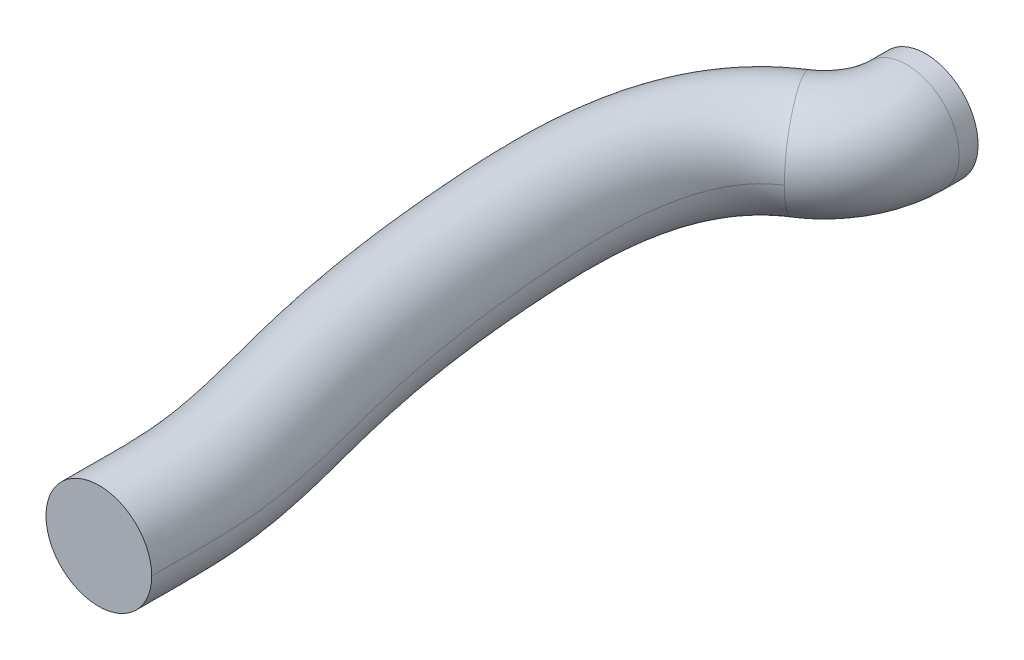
ISO-10303-21;
HEADER;
FILE_DESCRIPTION(('STEP AP214'),'2;1');
FILE_NAME('part.step','',(''),(''),'','','');
FILE_SCHEMA(('AUTOMOTIVE_DESIGN { 1 0 10303 214 1 1 1 1 }'));
ENDSEC;
DATA;
#1=APPLICATION_CONTEXT('core data for automotive mechanical design processes');
#2=APPLICATION_PROTOCOL_DEFINITION('international standard','automotive_design',2000,#1);
#3=PRODUCT_CONTEXT('',#1,'mechanical');
#4=PRODUCT('Part','Part','',(#3));
#5=PRODUCT_RELATED_PRODUCT_CATEGORY('part','',(#4));
#6=PRODUCT_DEFINITION_FORMATION('','',#4);
#7=PRODUCT_DEFINITION_CONTEXT('part definition',#1,'design');
#8=PRODUCT_DEFINITION('design','',#6,#7);
#9=PRODUCT_DEFINITION_SHAPE('','',#8);
#10=(LENGTH_UNIT() NAMED_UNIT(*) SI_UNIT(.MILLI.,.METRE.));
#11=(NAMED_UNIT(*) PLANE_ANGLE_UNIT() SI_UNIT($,.RADIAN.));
#12=(NAMED_UNIT(*) SI_UNIT($,.STERADIAN.) SOLID_ANGLE_UNIT());
#13=UNCERTAINTY_MEASURE_WITH_UNIT(LENGTH_MEASURE(1.E-05),#10,'distance_accuracy_value','');
#14=(GEOMETRIC_REPRESENTATION_CONTEXT(3) GLOBAL_UNCERTAINTY_ASSIGNED_CONTEXT((#13)) GLOBAL_UNIT_ASSIGNED_CONTEXT((#10,
#11,#12)) REPRESENTATION_CONTEXT('',''));
#15=CARTESIAN_POINT('',(0.,0.,0.));
#16=DIRECTION('',(0.,0.,1.));
#17=DIRECTION('',(1.,0.,0.));
#18=AXIS2_PLACEMENT_3D('',#15,#16,#17);
#19=CARTESIAN_POINT('',(-2.26,0.,44.97));
#20=DIRECTION('',(0.00673182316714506,0.,0.999977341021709));
#21=DIRECTION('',(0.999977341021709,0.,-0.00673182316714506));
#22=AXIS2_PLACEMENT_3D('',#19,#20,#21);
#23=PLANE('',#22);
#24=CARTESIAN_POINT('',(-5.25993202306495,1.45383705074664E-10,44.9901954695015));
#25=CARTESIAN_POINT('',(-5.25994010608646,0.0843776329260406,44.9901955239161));
#26=CARTESIAN_POINT('',(-5.2563723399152,0.168751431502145,44.9901715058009));
#27=CARTESIAN_POINT('',(-5.24214766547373,0.336895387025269,44.9900757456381));
#28=CARTESIAN_POINT('',(-5.23149109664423,0.420665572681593,44.9900040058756));
#29=CARTESIAN_POINT('',(-5.2031613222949,0.586956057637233,44.9898132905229));
#30=CARTESIAN_POINT('',(-5.18549305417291,0.669477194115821,44.9896943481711));
#31=CARTESIAN_POINT('',(-5.14328322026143,0.83271754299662,44.9894101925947));
#32=CARTESIAN_POINT('',(-5.11874173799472,0.913436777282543,44.9892449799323));
#33=CARTESIAN_POINT('',(-5.03500659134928,1.15211016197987,44.9886812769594));
#34=CARTESIAN_POINT('',(-4.96569016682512,1.30665040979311,44.9882146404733));
#35=CARTESIAN_POINT('',(-4.80214430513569,1.60178306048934,44.9871136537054));
#36=CARTESIAN_POINT('',(-4.70791976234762,1.74237819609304,44.9864793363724));
#37=CARTESIAN_POINT('',(-4.49719533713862,2.00578158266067,44.9850607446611));
#38=CARTESIAN_POINT('',(-4.38069496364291,2.12858944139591,44.9842764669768));
#39=CARTESIAN_POINT('',(-4.1287149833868,2.35291555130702,44.9825801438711));
#40=CARTESIAN_POINT('',(-3.99323248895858,2.45443055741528,44.9816680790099));
#41=CARTESIAN_POINT('',(-3.70715275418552,2.63326944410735,44.9797421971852));
#42=CARTESIAN_POINT('',(-3.55655618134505,2.71059439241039,44.9787283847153));
#43=CARTESIAN_POINT('',(-3.24452859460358,2.83885751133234,44.9766278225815));
#44=CARTESIAN_POINT('',(-3.08309827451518,2.88979736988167,44.9755410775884));
#45=CARTESIAN_POINT('',(-2.75397518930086,2.96385438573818,44.9733254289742));
#46=CARTESIAN_POINT('',(-2.58628229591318,2.98697097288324,44.9721965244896));
#47=CARTESIAN_POINT('',(-2.24938640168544,3.00471900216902,44.9699285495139));
#48=CARTESIAN_POINT('',(-2.08018336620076,2.99934978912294,44.9687894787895));
#49=CARTESIAN_POINT('',(-1.74510261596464,2.96029370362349,44.9665337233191));
#50=CARTESIAN_POINT('',(-1.57922486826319,2.92660711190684,44.9654170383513));
#51=CARTESIAN_POINT('',(-1.25540275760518,2.83181204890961,44.963237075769));
#52=CARTESIAN_POINT('',(-1.09745836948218,2.77070366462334,44.9621737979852));
#53=CARTESIAN_POINT('',(-0.870054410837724,2.6599083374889,44.9606429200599));
#54=CARTESIAN_POINT('',(-0.795802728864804,2.61976214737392,44.9601430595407));
#55=CARTESIAN_POINT('',(-0.650941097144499,2.53336005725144,44.9591678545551));
#56=CARTESIAN_POINT('',(-0.580330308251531,2.48710557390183,44.9586925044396));
#57=CARTESIAN_POINT('',(-0.443287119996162,2.38883073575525,44.9577699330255));
#58=CARTESIAN_POINT('',(-0.376852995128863,2.33681278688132,44.9573227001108));
#59=CARTESIAN_POINT('',(-0.248548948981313,2.22733210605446,44.956458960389));
#60=CARTESIAN_POINT('',(-0.186683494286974,2.16986416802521,44.9560424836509));
#61=CARTESIAN_POINT('',(-0.00877301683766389,1.99000567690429,44.9548447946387));
#62=CARTESIAN_POINT('',(0.0997702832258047,1.86002810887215,44.9541140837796));
#63=CARTESIAN_POINT('',(0.293455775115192,1.58367857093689,44.9528101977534));
#64=CARTESIAN_POINT('',(0.378598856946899,1.43730722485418,44.952237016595));
#65=CARTESIAN_POINT('',(0.486991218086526,1.20865828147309,44.9515073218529));
#66=CARTESIAN_POINT('',(0.519925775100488,1.13084102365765,44.9512856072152));
#67=CARTESIAN_POINT('',(0.579101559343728,0.972751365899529,44.9508872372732));
#68=CARTESIAN_POINT('',(0.605348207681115,0.892481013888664,44.9507105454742));
#69=CARTESIAN_POINT('',(0.650958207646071,0.730100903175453,44.9504035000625));
#70=CARTESIAN_POINT('',(0.670328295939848,0.647993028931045,44.9502731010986));
#71=CARTESIAN_POINT('',(0.702083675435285,0.4824527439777,44.9500593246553));
#72=CARTESIAN_POINT('',(0.714471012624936,0.399020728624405,44.9499759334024));
#73=CARTESIAN_POINT('',(0.728860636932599,0.262839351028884,44.9498790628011));
#74=CARTESIAN_POINT('',(0.733015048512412,0.21030791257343,44.9498510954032));
#75=CARTESIAN_POINT('',(0.738548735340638,0.105186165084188,44.9498138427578));
#76=CARTESIAN_POINT('',(0.739932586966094,0.0525960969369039,44.9498045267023));
#77=CARTESIAN_POINT('',(0.73993202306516,-3.38319650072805E-10,44.9498045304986));
#78=B_SPLINE_CURVE_WITH_KNOTS('',3,(#24,#25,#26,#27,#28,#29,#30,#31,#32,#33,#34,#35,#36,#37,#38,
#39,#40,#41,#42,#43,#44,#45,#46,#47,#48,#49,#50,#51,#52,#53,#54,#55,#56,#57,#58,#59,#60,#61,#62,
#63,#64,#65,#66,#67,#68,#69,#70,#71,#72,#73,#74,#75,#76,#77),.UNSPECIFIED.,.F.,.F.,(4,2,2,2,2,2,
2,2,2,2,2,2,2,2,2,2,2,2,2,2,2,2,2,2,2,2,4),(0.,0.253050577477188,0.506089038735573,
0.758949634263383,1.01180715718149,1.51731058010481,2.02271474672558,2.52813005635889,
3.03362233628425,3.53909230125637,4.04452992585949,4.5499779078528,5.05543751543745,
5.56089211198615,6.06634510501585,6.3193324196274,6.57226116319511,6.82508471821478,
7.07815226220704,7.58361567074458,8.08905985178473,8.34230891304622,8.59535203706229,
8.8481465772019,9.10086700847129,9.25888633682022,9.41664443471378),.UNSPECIFIED.);
#79=CARTESIAN_POINT('',(-5.25993202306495,1.44925738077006E-10,44.9901954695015));
#80=VERTEX_POINT('',#79);
#81=CARTESIAN_POINT('',(0.739932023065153,-1.69621261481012E-10,44.9498045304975));
#82=VERTEX_POINT('',#81);
#83=EDGE_CURVE('E81',#80,#82,#78,.T.);
#84=ORIENTED_EDGE('',*,*,#83,.F.);
#85=CARTESIAN_POINT('',(0.73993202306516,-3.39249461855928E-10,44.9498045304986));
#86=CARTESIAN_POINT('',(0.739940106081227,-0.0843776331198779,44.9498044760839));
#87=CARTESIAN_POINT('',(0.736372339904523,-0.168751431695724,44.9498284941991));
#88=CARTESIAN_POINT('',(0.722147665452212,-0.336895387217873,44.9499242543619));
#89=CARTESIAN_POINT('',(0.711491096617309,-0.420665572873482,44.9499959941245));
#90=CARTESIAN_POINT('',(0.683161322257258,-0.58695605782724,44.9501867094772));
#91=CARTESIAN_POINT('',(0.66549305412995,-0.669477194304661,44.950305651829));
#92=CARTESIAN_POINT('',(0.623283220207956,-0.832717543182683,44.9505898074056));
#93=CARTESIAN_POINT('',(0.598741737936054,-0.913436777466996,44.9507550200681));
#94=CARTESIAN_POINT('',(0.515006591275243,-1.15211016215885,44.9513187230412));
#95=CARTESIAN_POINT('',(0.445690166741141,-1.30665040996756,44.9517853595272));
#96=CARTESIAN_POINT('',(0.282144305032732,-1.60178306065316,44.9528863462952));
#97=CARTESIAN_POINT('',(0.187919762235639,-1.74237819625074,44.9535206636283));
#98=CARTESIAN_POINT('',(-0.0228046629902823,-2.0057815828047,44.9549392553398));
#99=CARTESIAN_POINT('',(-0.139305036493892,-2.12858944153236,44.955723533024));
#100=CARTESIAN_POINT('',(-0.391285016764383,-2.35291555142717,44.9574198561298));
#101=CARTESIAN_POINT('',(-0.526767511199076,-2.45443055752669,44.958331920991));
#102=CARTESIAN_POINT('',(-0.812847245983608,-2.63326944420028,44.9602578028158));
#103=CARTESIAN_POINT('',(-0.96344381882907,-2.71059439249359,44.9612716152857));
#104=CARTESIAN_POINT('',(-1.2754714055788,-2.83885751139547,44.9633721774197));
#105=CARTESIAN_POINT('',(-1.43690172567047,-2.88979736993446,44.9644589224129));
#106=CARTESIAN_POINT('',(-1.76602481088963,-2.96385438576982,44.9666745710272));
#107=CARTESIAN_POINT('',(-1.93371770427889,-2.98697097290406,44.9678034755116));
#108=CARTESIAN_POINT('',(-2.27061359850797,-3.00471900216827,44.9700714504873));
#109=CARTESIAN_POINT('',(-2.4398166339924,-2.99934978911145,44.9712105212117));
#110=CARTESIAN_POINT('',(-2.77489738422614,-2.96029370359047,44.9734662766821));
#111=CARTESIAN_POINT('',(-2.94077513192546,-2.92660711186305,44.9745829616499));
#112=CARTESIAN_POINT('',(-3.26459724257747,-2.83181204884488,44.9767629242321));
#113=CARTESIAN_POINT('',(-3.4225416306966,-2.77070366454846,44.977826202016));
#114=CARTESIAN_POINT('',(-3.64994558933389,-2.65990833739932,44.9793570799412));
#115=CARTESIAN_POINT('',(-3.72419727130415,-2.61976214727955,44.9798569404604));
#116=CARTESIAN_POINT('',(-3.86905890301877,-2.53336005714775,44.9808321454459));
#117=CARTESIAN_POINT('',(-3.93966969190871,-2.48710557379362,44.9813074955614));
#118=CARTESIAN_POINT('',(-4.07671288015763,-2.38883073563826,44.9822300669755));
#119=CARTESIAN_POINT('',(-4.14314700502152,-2.33681278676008,44.9826772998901));
#120=CARTESIAN_POINT('',(-4.27145105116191,-2.22733210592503,44.9835410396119));
#121=CARTESIAN_POINT('',(-4.3333165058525,-2.16986416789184,44.98395751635));
#122=CARTESIAN_POINT('',(-4.51122698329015,-1.99000567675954,44.9851552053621));
#123=CARTESIAN_POINT('',(-4.6197702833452,-1.86002810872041,44.9858859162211));
#124=CARTESIAN_POINT('',(-4.81345577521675,-1.58367857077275,44.9871898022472));
#125=CARTESIAN_POINT('',(-4.89859885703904,-1.43730722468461,44.9877629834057));
#126=CARTESIAN_POINT('',(-5.00699121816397,-1.20865828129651,44.9884926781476));
#127=CARTESIAN_POINT('',(-5.03992577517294,-1.13084102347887,44.9887143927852));
#128=CARTESIAN_POINT('',(-5.09910155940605,-0.972751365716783,44.9891127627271));
#129=CARTESIAN_POINT('',(-5.1253482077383,-0.892481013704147,44.9892894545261));
#130=CARTESIAN_POINT('',(-5.17095820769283,-0.730100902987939,44.9895964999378));
#131=CARTESIAN_POINT('',(-5.19032829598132,-0.647993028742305,44.9897268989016));
#132=CARTESIAN_POINT('',(-5.22208367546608,-0.482452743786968,44.9899406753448));
#133=CARTESIAN_POINT('',(-5.23447101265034,-0.399020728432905,44.9900240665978));
#134=CARTESIAN_POINT('',(-5.24886063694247,-0.262839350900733,44.990120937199));
#135=CARTESIAN_POINT('',(-5.25301504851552,-0.21030791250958,44.9901489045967));
#136=CARTESIAN_POINT('',(-5.25854873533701,-0.105186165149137,44.990186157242));
#137=CARTESIAN_POINT('',(-5.25993258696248,-0.0525960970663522,44.9901954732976));
#138=CARTESIAN_POINT('',(-5.25993202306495,1.44460832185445E-10,44.9901954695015));
#139=B_SPLINE_CURVE_WITH_KNOTS('',3,(#85,#86,#87,#88,#89,#90,#91,#92,#93,#94,#95,#96,#97,#98,
#99,#100,#101,#102,#103,#104,#105,#106,#107,#108,#109,#110,#111,#112,#113,#114,#115,#116,#117,
#118,#119,#120,#121,#122,#123,#124,#125,#126,#127,#128,#129,#130,#131,#132,#133,#134,#135,#136,
#137,#138),.UNSPECIFIED.,.F.,.F.,(4,2,2,2,2,2,2,2,2,2,2,2,2,2,2,2,2,2,2,2,2,2,2,2,2,2,4),(0.,
0.253050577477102,0.506089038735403,0.75894963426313,1.01180715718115,1.51731058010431,
2.02271474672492,2.52813005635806,3.03362233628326,3.53909230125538,4.0445299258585,
4.5499779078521,5.05543751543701,5.56089211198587,6.06634510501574,6.31933241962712,
6.57226116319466,6.82508471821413,7.07815226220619,7.58361567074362,8.08905985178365,
8.34230891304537,8.59535203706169,8.84814657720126,9.1008670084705,9.25888633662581,
9.4166444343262),.UNSPECIFIED.);
#140=EDGE_CURVE('E45',#82,#80,#139,.T.);
#141=ORIENTED_EDGE('',*,*,#140,.F.);
#142=EDGE_LOOP('',(#84,#141));
#143=FACE_BOUND('',#142,.T.);
#144=ADVANCED_FACE('F41',(#143),#23,.T.);
#145=CARTESIAN_POINT('',(-3.391908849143,0.188366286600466,2.27201380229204));
#146=CARTESIAN_POINT('',(-3.520611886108,0.188370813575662,2.34764275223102));
#147=CARTESIAN_POINT('',(-3.966178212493,0.188372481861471,2.62196351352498));
#148=CARTESIAN_POINT('',(-4.70882778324,0.188370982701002,3.15737725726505));
#149=CARTESIAN_POINT('',(-5.558270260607,0.188370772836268,3.923113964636));
#150=CARTESIAN_POINT('',(-6.341254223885,0.188371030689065,4.80531311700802));
#151=CARTESIAN_POINT('',(-7.24071286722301,0.188371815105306,6.07910325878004));
#152=CARTESIAN_POINT('',(-7.922374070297,0.18836414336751,7.46487549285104));
#153=CARTESIAN_POINT('',(-8.422120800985,0.188380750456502,8.91671801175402));
#154=CARTESIAN_POINT('',(-8.799341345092,0.188370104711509,10.38320063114));
#155=CARTESIAN_POINT('',(-9.08909986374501,0.18837371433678,12.25624041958));
#156=CARTESIAN_POINT('',(-9.19226702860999,0.188373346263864,14.0846262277));
#157=CARTESIAN_POINT('',(-9.198581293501,0.188370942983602,15.58059367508));
#158=CARTESIAN_POINT('',(-9.17043015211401,0.18837181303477,16.69984550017));
#159=CARTESIAN_POINT('',(-9.123940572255,0.188371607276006,17.64373417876));
#160=CARTESIAN_POINT('',(-9.07585713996,0.188371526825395,18.40815568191));
#161=CARTESIAN_POINT('',(-9.03137433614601,0.188371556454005,19.03441797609));
#162=CARTESIAN_POINT('',(-8.97790522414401,0.188371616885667,19.71856310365));
#163=CARTESIAN_POINT('',(-8.91496099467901,0.188371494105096,20.44706303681));
#164=CARTESIAN_POINT('',(-8.84259796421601,0.188371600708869,21.206762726));
#165=CARTESIAN_POINT('',(-8.736267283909,0.188371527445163,22.2219025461));
#166=CARTESIAN_POINT('',(-8.58061200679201,0.188371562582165,23.52291603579));
#167=CARTESIAN_POINT('',(-8.367326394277,0.188371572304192,25.03681162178));
#168=CARTESIAN_POINT('',(-8.11758982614,0.188371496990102,26.57081041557));
#169=CARTESIAN_POINT('',(-7.886420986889,0.188371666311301,27.81983001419));
#170=CARTESIAN_POINT('',(-7.67703459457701,0.188371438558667,28.85527170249));
#171=CARTESIAN_POINT('',(-7.509086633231,0.188371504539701,29.64099790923));
#172=CARTESIAN_POINT('',(-7.32229731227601,0.188371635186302,30.46896254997));
#173=CARTESIAN_POINT('',(-7.151822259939,0.188371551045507,31.18586730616));
#174=CARTESIAN_POINT('',(-6.99985267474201,0.188371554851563,31.80038725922));
#175=CARTESIAN_POINT('',(-6.876706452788,0.188371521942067,32.28804969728));
#176=CARTESIAN_POINT('',(-6.746069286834,0.188371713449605,32.79821574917));
#177=CARTESIAN_POINT('',(-6.569736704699,0.188371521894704,33.48206955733));
#178=CARTESIAN_POINT('',(-6.343587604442,0.188371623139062,34.3608186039));
#179=CARTESIAN_POINT('',(-6.089626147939,0.18837157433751,35.38319836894));
#180=CARTESIAN_POINT('',(-5.851926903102,0.188371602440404,36.41380752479));
#181=CARTESIAN_POINT('',(-5.681835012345,0.188371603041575,37.24438094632));
#182=CARTESIAN_POINT('',(-5.56047800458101,0.188371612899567,37.92457033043));
#183=CARTESIAN_POINT('',(-5.479561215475,0.1883713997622,38.43538558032));
#184=CARTESIAN_POINT('',(-5.407542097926,0.188371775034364,38.96843737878));
#185=CARTESIAN_POINT('',(-5.359688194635,0.188371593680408,39.40945219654));
#186=CARTESIAN_POINT('',(-5.328200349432,0.188371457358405,39.77514182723));
#187=CARTESIAN_POINT('',(-5.30797157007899,0.188371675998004,40.05533015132));
#188=CARTESIAN_POINT('',(-5.290302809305,0.1883714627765,40.35502799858));
#189=CARTESIAN_POINT('',(-5.27124183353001,0.188371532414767,40.76542201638));
#190=CARTESIAN_POINT('',(-5.255069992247,0.188371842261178,41.31092417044));
#191=CARTESIAN_POINT('',(-5.247069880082,0.1883708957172,41.97490840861));
#192=CARTESIAN_POINT('',(-5.246879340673,0.1883732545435,42.67491317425));
#193=CARTESIAN_POINT('',(-5.2525932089,0.18837091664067,43.65875636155));
#194=CARTESIAN_POINT('',(-5.258597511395,0.1883701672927,44.58754320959));
#195=CARTESIAN_POINT('',(-5.251545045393,0.188372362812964,45.28223099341));
#196=CARTESIAN_POINT('',(-5.249408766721,0.188375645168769,45.42966595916));
#197=CARTESIAN_POINT('',(-3.450662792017,-1.65413489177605,2.17208445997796));
#198=CARTESIAN_POINT('',(-3.58071797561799,-1.65417464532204,2.24850678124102));
#199=CARTESIAN_POINT('',(-4.03101535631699,-1.65418929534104,2.52573829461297));
#200=CARTESIAN_POINT('',(-4.781799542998,-1.65417613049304,3.06700655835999));
#201=CARTESIAN_POINT('',(-5.64072517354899,-1.65417428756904,3.84128974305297));
#202=CARTESIAN_POINT('',(-6.432365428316,-1.65417655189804,4.73325322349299));
#203=CARTESIAN_POINT('',(-7.34139648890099,-1.65418344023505,6.02064399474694));
#204=CARTESIAN_POINT('',(-8.029502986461,-1.65411607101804,7.41978634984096));
#205=CARTESIAN_POINT('',(-8.53334392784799,-1.65426190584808,8.88359128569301));
#206=CARTESIAN_POINT('',(-8.91325780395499,-1.65416842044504,10.36069175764));
#207=CARTESIAN_POINT('',(-9.204629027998,-1.65420011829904,12.2447104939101));
#208=CARTESIAN_POINT('',(-9.30818507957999,-1.65419688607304,14.08096586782));
#209=CARTESIAN_POINT('',(-9.31451359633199,-1.65417578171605,15.58193559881));
#210=CARTESIAN_POINT('',(-9.28628061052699,-1.65418342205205,16.70426288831));
#211=CARTESIAN_POINT('',(-9.23968812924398,-1.65418161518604,17.65018595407));
#212=CARTESIAN_POINT('',(-9.19152000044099,-1.65418090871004,18.41594435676));
#213=CARTESIAN_POINT('',(-9.14697590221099,-1.65418116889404,19.04306565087));
#214=CARTESIAN_POINT('',(-9.09343999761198,-1.65418169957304,19.72806531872));
#215=CARTESIAN_POINT('',(-9.03041161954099,-1.65418062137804,20.45754034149));
#216=CARTESIAN_POINT('',(-8.95794794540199,-1.65418155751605,21.21829795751));
#217=CARTESIAN_POINT('',(-8.851464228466,-1.65418091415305,22.23489970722));
#218=CARTESIAN_POINT('',(-8.69557378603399,-1.65418122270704,23.5378836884));
#219=CARTESIAN_POINT('',(-8.481949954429,-1.65418130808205,25.05418371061));
#220=CARTESIAN_POINT('',(-8.23180567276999,-1.654180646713,26.59068796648));
#221=CARTESIAN_POINT('',(-8.00025691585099,-1.65418213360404,27.84176052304));
#222=CARTESIAN_POINT('',(-7.79052941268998,-1.654180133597,28.87888829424));
#223=CARTESIAN_POINT('',(-7.62231100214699,-1.65418071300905,29.66587907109));
#224=CARTESIAN_POINT('',(-7.435231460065,-1.65418186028,30.49513110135));
#225=CARTESIAN_POINT('',(-7.26448559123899,-1.65418112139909,31.21317310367));
#226=CARTESIAN_POINT('',(-7.11230920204,-1.654181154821,31.82852836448));
#227=CARTESIAN_POINT('',(-6.989045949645,-1.65418086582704,32.31665313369));
#228=CARTESIAN_POINT('',(-6.85833683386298,-1.65418254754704,32.82710020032));
#229=CARTESIAN_POINT('',(-6.68197692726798,-1.65418086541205,33.51105907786));
#230=CARTESIAN_POINT('',(-6.45593681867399,-1.65418175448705,34.38938769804));
#231=CARTESIAN_POINT('',(-6.20232458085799,-1.65418132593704,35.41037500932));
#232=CARTESIAN_POINT('',(-5.96517520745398,-1.65418157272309,36.43862169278));
#233=CARTESIAN_POINT('',(-5.79564991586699,-1.65418157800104,37.26646223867));
#234=CARTESIAN_POINT('',(-5.674793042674,-1.65418166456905,37.94385943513));
#235=CARTESIAN_POINT('',(-5.594258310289,-1.65417979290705,38.45227035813));
#236=CARTESIAN_POINT('',(-5.522621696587,-1.65418308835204,38.98251427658));
#237=CARTESIAN_POINT('',(-5.475062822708,-1.65418149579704,39.42082208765));
#238=CARTESIAN_POINT('',(-5.443769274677,-1.65418029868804,39.78425065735));
#239=CARTESIAN_POINT('',(-5.423652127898,-1.654182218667,40.06288482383));
#240=CARTESIAN_POINT('',(-5.406070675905,-1.65418034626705,40.36109143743));
#241=CARTESIAN_POINT('',(-5.387093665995,-1.65418095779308,40.76966299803));
#242=CARTESIAN_POINT('',(-5.37097730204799,-1.65418367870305,41.31320141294));
#243=CARTESIAN_POINT('',(-5.36299393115,-1.65417536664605,41.97551448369));
#244=CARTESIAN_POINT('',(-5.36280391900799,-1.65419608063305,42.67447315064));
#245=CARTESIAN_POINT('',(-5.368511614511,-1.65417555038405,43.65779957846));
#246=CARTESIAN_POINT('',(-5.37452695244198,-1.65416897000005,44.58744707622));
#247=CARTESIAN_POINT('',(-5.36746144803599,-1.654188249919,45.28358707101));
#248=CARTESIAN_POINT('',(-5.365321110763,-1.65421707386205,45.43136514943));
#249=CARTESIAN_POINT('',(-2.810122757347,-2.99991603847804,3.26152188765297));
#250=CARTESIAN_POINT('',(-2.92543673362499,-2.99998813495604,3.329294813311));
#251=CARTESIAN_POINT('',(-3.32415579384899,-3.00001470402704,3.57479308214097));
#252=CARTESIAN_POINT('',(-3.98625576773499,-2.99999082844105,4.05223491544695));
#253=CARTESIAN_POINT('',(-4.741795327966,-2.99998748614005,4.73334374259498));
#254=CARTESIAN_POINT('',(-5.43906402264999,-2.99999159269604,5.51885576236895));
#255=CARTESIAN_POINT('',(-6.243735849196,-3.00000408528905,6.65797141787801));
#256=CARTESIAN_POINT('',(-6.86157524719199,-2.999881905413,7.91135167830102));
#257=CARTESIAN_POINT('',(-7.32078078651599,-3.00014638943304,9.24474141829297));
#258=CARTESIAN_POINT('',(-7.671331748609,-2.99997684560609,10.6060852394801));
#259=CARTESIAN_POINT('',(-7.945121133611,-3.00003433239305,12.37041063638));
#260=CARTESIAN_POINT('',(-8.04443751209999,-3.00002847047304,14.12087139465));
#261=CARTESIAN_POINT('',(-8.05061065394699,-2.99999019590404,15.56730584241));
#262=CARTESIAN_POINT('',(-8.02326994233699,-3.00000405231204,16.65610418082));
#263=CARTESIAN_POINT('',(-7.97779930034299,-3.00000077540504,17.57984820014));
#264=CARTESIAN_POINT('',(-7.930554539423,-2.99999949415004,18.33103162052));
#265=CARTESIAN_POINT('',(-7.88667867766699,-2.99999996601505,18.94878803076));
#266=CARTESIAN_POINT('',(-7.833870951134,-3.00000092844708,19.6244714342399));
#267=CARTESIAN_POINT('',(-7.77175996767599,-2.999998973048,20.34331595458));
#268=CARTESIAN_POINT('',(-7.70039351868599,-3.00000067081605,21.09253997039));
#269=CARTESIAN_POINT('',(-7.595578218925,-2.99999950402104,22.09320365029));
#270=CARTESIAN_POINT('',(-7.44225156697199,-3.00000006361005,23.3747051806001));
#271=CARTESIAN_POINT('',(-7.232315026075,-3.000000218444,24.86479185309));
#272=CARTESIAN_POINT('',(-6.986615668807,-2.99999901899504,26.37398136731));
#273=CARTESIAN_POINT('',(-6.75920880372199,-3.00000171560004,27.60267241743));
#274=CARTESIAN_POINT('',(-6.553200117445,-2.99999808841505,28.62141838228));
#275=CARTESIAN_POINT('',(-6.38793016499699,-2.99999913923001,29.3946227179));
#276=CARTESIAN_POINT('',(-6.204014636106,-3.00000121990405,30.20983952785));
#277=CARTESIAN_POINT('',(-6.03622122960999,-2.99999987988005,30.91548318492));
#278=CARTESIAN_POINT('',(-5.886299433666,-2.99999994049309,31.52173185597));
#279=CARTESIAN_POINT('',(-5.76431205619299,-2.99999941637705,32.0048162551));
#280=CARTESIAN_POINT('',(-5.634387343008,-3.00000246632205,32.5121996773));
#281=CARTESIAN_POINT('',(-5.458325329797,-2.99999941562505,33.19501308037));
#282=CARTESIAN_POINT('',(-5.23109698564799,-3.000001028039,34.0779252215));
#283=CARTESIAN_POINT('',(-4.97367753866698,-3.00000025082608,35.11409317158));
#284=CARTESIAN_POINT('',(-4.730533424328,-3.00000069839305,36.16809571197));
#285=CARTESIAN_POINT('',(-4.554831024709,-3.00000070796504,37.02573027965));
#286=CARTESIAN_POINT('',(-4.42852164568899,-3.00000086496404,37.73356812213));
#287=CARTESIAN_POINT('',(-4.343821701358,-2.99999747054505,38.26819120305));
#288=CARTESIAN_POINT('',(-4.268015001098,-3.00000344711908,38.82904684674));
#289=CARTESIAN_POINT('',(-4.21723969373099,-3.00000055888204,39.29686665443));
#290=CARTESIAN_POINT('',(-4.18382790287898,-2.99999838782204,39.68494548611));
#291=CARTESIAN_POINT('',(-4.16249372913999,-3.00000186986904,39.98052319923));
#292=CARTESIAN_POINT('',(-4.143960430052,-2.99999847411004,40.29498735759));
#293=CARTESIAN_POINT('',(-4.12406801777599,-2.99999958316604,40.72342748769));
#294=CARTESIAN_POINT('',(-4.107346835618,-3.00000451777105,41.28837473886));
#295=CARTESIAN_POINT('',(-4.099180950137,-2.99998944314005,41.96890700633));
#296=CARTESIAN_POINT('',(-4.09898518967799,-3.00002700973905,42.6792703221));
#297=CARTESIAN_POINT('',(-4.10476018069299,-2.99998977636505,43.66823050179));
#298=CARTESIAN_POINT('',(-4.110655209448,-2.999977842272,44.58849512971));
#299=CARTESIAN_POINT('',(-4.10373185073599,-3.00001280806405,45.26880300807));
#300=CARTESIAN_POINT('',(-4.101635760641,-3.00006508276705,45.41284044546));
#301=CARTESIAN_POINT('',(-1.87440916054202,-2.999916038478,4.85299370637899));
#302=CARTESIAN_POINT('',(-1.968188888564,-2.99998813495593,4.90813142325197));
#303=CARTESIAN_POINT('',(-2.291561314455,-3.00001470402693,5.10727313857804));
#304=CARTESIAN_POINT('',(-2.824109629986,-2.999990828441,5.49147605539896));
#305=CARTESIAN_POINT('',(-3.428620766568,-2.99998748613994,6.03647393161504));
#306=CARTESIAN_POINT('',(-3.988029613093,-2.99999159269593,6.66647954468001));
#307=CARTESIAN_POINT('',(-4.640251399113,-3.00000408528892,7.58899196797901));
#308=CARTESIAN_POINT('',(-5.15544322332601,-2.99988190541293,8.62944006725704));
#309=CARTESIAN_POINT('',(-5.549444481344,-3.000146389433,9.772316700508));
#310=CARTESIAN_POINT('',(-5.85710151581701,-2.99997684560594,10.96456090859));
#311=CARTESIAN_POINT('',(-6.105207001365,-3.00003433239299,12.55403589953));
#312=CARTESIAN_POINT('',(-6.198329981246,-3.000028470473,14.17916618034));
#313=CARTESIAN_POINT('',(-6.20427614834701,-2.99999019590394,15.54593440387));
#314=CARTESIAN_POINT('',(-6.178238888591,-3.000004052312,16.58575298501));
#315=CARTESIAN_POINT('',(-6.134407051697,-3.00000077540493,17.47709741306));
#316=CARTESIAN_POINT('',(-6.08851116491,-2.99999949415,18.20698940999));
#317=CARTESIAN_POINT('',(-6.045611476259,-2.999999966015,18.81106541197));
#318=CARTESIAN_POINT('',(-5.993867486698,-3.00000092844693,19.47313943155));
#319=CARTESIAN_POINT('',(-5.9330966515,-2.99999897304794,20.17645470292));
#320=CARTESIAN_POINT('',(-5.86333305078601,-3.00000067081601,20.90883020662));
#321=CARTESIAN_POINT('',(-5.760955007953,-2.999999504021,21.8862112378));
#322=CARTESIAN_POINT('',(-5.611373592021,-3.00000006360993,23.13633077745));
#323=CARTESIAN_POINT('',(-5.406823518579,-3.00000021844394,24.58812446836));
#324=CARTESIAN_POINT('',(-5.16761739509,-2.99999901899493,26.05741206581));
#325=CARTESIAN_POINT('',(-4.946261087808,-3.00000171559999,27.25340776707));
#326=CARTESIAN_POINT('',(-4.74568492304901,-2.999998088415,28.24530122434));
#327=CARTESIAN_POINT('',(-4.584722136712,-2.99999913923,28.99836605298));
#328=CARTESIAN_POINT('',(-4.405428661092,-3.000001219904,29.7930799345));
#329=CARTESIAN_POINT('',(-4.241948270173,-2.99999987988,30.48061184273));
#330=CARTESIAN_POINT('',(-4.095320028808,-2.99999994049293,31.0735574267));
#331=CARTESIAN_POINT('',(-3.975196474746,-2.99999941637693,31.54927875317));
#332=CARTESIAN_POINT('',(-3.84641763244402,-3.00000246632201,32.05218674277));
#333=CARTESIAN_POINT('',(-3.670790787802,-2.99999941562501,32.73332681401));
#334=CARTESIAN_POINT('',(-3.441826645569,-3.00000102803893,33.62293465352));
#335=CARTESIAN_POINT('',(-3.17884555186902,-3.000000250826,34.68127878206));
#336=CARTESIAN_POINT('',(-2.926944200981,-3.00000069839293,35.77290598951));
#337=CARTESIAN_POINT('',(-2.74221815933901,-3.00000070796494,36.67406425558));
#338=CARTESIAN_POINT('',(-2.60794365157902,-3.000000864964,37.42637039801));
#339=CARTESIAN_POINT('',(-2.517159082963,-2.99999747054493,37.99928471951));
#340=CARTESIAN_POINT('',(-2.435260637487,-3.000003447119,38.60485857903));
#341=CARTESIAN_POINT('',(-2.379786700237,-3.00000055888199,39.11579009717));
#342=CARTESIAN_POINT('',(-2.343280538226,-2.99999838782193,39.53987852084));
#343=CARTESIAN_POINT('',(-2.320168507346,-3.00000186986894,39.8602077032));
#344=CARTESIAN_POINT('',(-2.30024473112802,-2.99999847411,40.19842120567));
#345=CARTESIAN_POINT('',(-2.279015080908,-2.999999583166,40.65588573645));
#346=CARTESIAN_POINT('',(-2.261410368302,-3.000004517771,41.25210744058));
#347=CARTESIAN_POINT('',(-2.252977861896,-2.99998944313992,41.95925467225));
#348=CARTESIAN_POINT('',(-2.252773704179,-3.000027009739,42.6862781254));
#349=CARTESIAN_POINT('',(-2.25864700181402,-2.999989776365,43.68346820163));
#350=CARTESIAN_POINT('',(-2.264366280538,-2.99997784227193,44.59002614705));
#351=CARTESIAN_POINT('',(-2.257650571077,-3.00001280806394,45.24720615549));
#352=CARTESIAN_POINT('',(-2.255619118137,-3.000065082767,45.3857791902));
#353=CARTESIAN_POINT('',(-0.938695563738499,-2.99991603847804,6.44446552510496));
#354=CARTESIAN_POINT('',(-1.010941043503,-2.99998813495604,6.48696803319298));
#355=CARTESIAN_POINT('',(-1.25896683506,-3.00001470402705,6.63975319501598));
#356=CARTESIAN_POINT('',(-1.66196349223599,-2.99999082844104,6.93071719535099));
#357=CARTESIAN_POINT('',(-2.11544620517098,-2.99998748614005,7.33960412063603));
#358=CARTESIAN_POINT('',(-2.536995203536,-2.99999159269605,7.81410332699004));
#359=CARTESIAN_POINT('',(-3.03676694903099,-3.00000408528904,8.52001251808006));
#360=CARTESIAN_POINT('',(-3.44931119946,-2.99988190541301,9.34752845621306));
#361=CARTESIAN_POINT('',(-3.778108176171,-3.00014638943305,10.29989198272));
#362=CARTESIAN_POINT('',(-4.042871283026,-2.99997684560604,11.32303657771));
#363=CARTESIAN_POINT('',(-4.265292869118,-3.00003433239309,12.7376611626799));
#364=CARTESIAN_POINT('',(-4.35222245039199,-3.00002847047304,14.23746096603));
#365=CARTESIAN_POINT('',(-4.357941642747,-2.99999019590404,15.52456296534));
#366=CARTESIAN_POINT('',(-4.33320783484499,-3.00000405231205,16.5154017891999));
#367=CARTESIAN_POINT('',(-4.29101480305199,-3.00000077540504,17.37434662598));
#368=CARTESIAN_POINT('',(-4.246467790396,-2.99999949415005,18.08294719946));
#369=CARTESIAN_POINT('',(-4.204544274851,-2.99999996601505,18.67334279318));
#370=CARTESIAN_POINT('',(-4.153864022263,-3.00000092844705,19.32180742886));
#371=CARTESIAN_POINT('',(-4.09443333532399,-2.99999897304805,20.00959345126));
#372=CARTESIAN_POINT('',(-4.026272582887,-3.00000067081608,20.72512044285));
#373=CARTESIAN_POINT('',(-3.92633179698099,-2.99999950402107,21.6792188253));
#374=CARTESIAN_POINT('',(-3.780495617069,-3.00000006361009,22.89795637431));
#375=CARTESIAN_POINT('',(-3.58133201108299,-3.00000021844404,24.31145708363));
#376=CARTESIAN_POINT('',(-3.34861912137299,-2.99999901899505,25.74084276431));
#377=CARTESIAN_POINT('',(-3.13331337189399,-3.00000171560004,26.9041431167));
#378=CARTESIAN_POINT('',(-2.938169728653,-2.99999808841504,27.8691840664));
#379=CARTESIAN_POINT('',(-2.781514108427,-2.99999913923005,28.60210938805));
#380=CARTESIAN_POINT('',(-2.606842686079,-3.00000121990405,29.37632034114));
#381=CARTESIAN_POINT('',(-2.44767531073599,-2.99999987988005,30.04574050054));
#382=CARTESIAN_POINT('',(-2.30434062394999,-2.99999994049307,30.62538299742));
#383=CARTESIAN_POINT('',(-2.18608089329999,-2.99999941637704,31.09374125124));
#384=CARTESIAN_POINT('',(-2.05844792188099,-3.00000246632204,31.59217380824));
#385=CARTESIAN_POINT('',(-1.88325624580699,-2.99999941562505,32.27164054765));
#386=CARTESIAN_POINT('',(-1.652556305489,-3.00000102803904,33.16794408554));
#387=CARTESIAN_POINT('',(-1.384013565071,-3.00000025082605,34.24846439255));
#388=CARTESIAN_POINT('',(-1.123354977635,-3.00000069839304,35.37771626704));
#389=CARTESIAN_POINT('',(-0.92960529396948,-3.00000070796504,36.32239823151));
#390=CARTESIAN_POINT('',(-0.787365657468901,-3.00000086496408,37.11917267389));
#391=CARTESIAN_POINT('',(-0.690496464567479,-2.99999747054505,37.73037823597));
#392=CARTESIAN_POINT('',(-0.6025062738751,-3.00000344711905,38.38067031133));
#393=CARTESIAN_POINT('',(-0.542333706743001,-3.00000055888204,38.93471353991));
#394=CARTESIAN_POINT('',(-0.502733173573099,-2.99999838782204,39.39481155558));
#395=CARTESIAN_POINT('',(-0.477843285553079,-3.00000186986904,39.73989220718));
#396=CARTESIAN_POINT('',(-0.456529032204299,-2.99999847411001,40.10185505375));
#397=CARTESIAN_POINT('',(-0.433962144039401,-2.99999958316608,40.5883439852));
#398=CARTESIAN_POINT('',(-0.415473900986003,-3.00000451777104,41.2158401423));
#399=CARTESIAN_POINT('',(-0.406774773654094,-2.99998944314,41.94960233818));
#400=CARTESIAN_POINT('',(-0.406562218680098,-3.00002700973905,42.69328592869));
#401=CARTESIAN_POINT('',(-0.4125338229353,-2.99998977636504,43.69870590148));
#402=CARTESIAN_POINT('',(-0.418077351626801,-2.99997784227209,44.5915571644));
#403=CARTESIAN_POINT('',(-0.411569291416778,-3.00001280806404,45.22560930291));
#404=CARTESIAN_POINT('',(-0.4096024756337,-3.00006508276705,45.35871793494));
#405=CARTESIAN_POINT('',(-0.2981555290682,-1.65413489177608,7.53390295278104));
#406=CARTESIAN_POINT('',(-0.3556598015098,-1.65417464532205,7.56775606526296));
#407=CARTESIAN_POINT('',(-0.552107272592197,-1.654189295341,7.68880798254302));
#408=CARTESIAN_POINT('',(-0.866419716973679,-1.65417613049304,7.91594555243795));
#409=CARTESIAN_POINT('',(-1.216516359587,-1.65417428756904,8.23165812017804));
#410=CARTESIAN_POINT('',(-1.54369379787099,-1.65417655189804,8.59970586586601));
#411=CARTESIAN_POINT('',(-1.93910630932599,-1.65418344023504,9.157339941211));
#412=CARTESIAN_POINT('',(-2.28138346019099,-1.65411607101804,9.83909378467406));
#413=CARTESIAN_POINT('',(-2.565545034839,-1.65426190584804,10.66104211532));
#414=CARTESIAN_POINT('',(-2.80094522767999,-1.65416842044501,11.56843005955));
#415=CARTESIAN_POINT('',(-3.005784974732,-1.65420011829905,12.8633613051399));
#416=CARTESIAN_POINT('',(-3.088474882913,-1.65419688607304,14.27736649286));
#417=CARTESIAN_POINT('',(-3.09403870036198,-1.65417578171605,15.50993320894));
#418=CARTESIAN_POINT('',(-3.07019716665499,-1.65418342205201,16.46724308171));
#419=CARTESIAN_POINT('',(-3.029125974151,-1.65418161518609,17.30400887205));
#420=CARTESIAN_POINT('',(-2.985502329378,-1.65418090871,17.99803446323));
#421=CARTESIAN_POINT('',(-2.94424705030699,-1.65418116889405,18.5790651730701));
#422=CARTESIAN_POINT('',(-2.89429497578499,-1.65418169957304,19.21821354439));
#423=CARTESIAN_POINT('',(-2.83578168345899,-1.65418062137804,19.89536906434));
#424=CARTESIAN_POINT('',(-2.768718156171,-1.65418155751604,20.5993624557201));
#425=CARTESIAN_POINT('',(-2.67044578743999,-1.65418091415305,21.5375227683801));
#426=CARTESIAN_POINT('',(-2.52717339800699,-1.65418122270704,22.7347778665));
#427=CARTESIAN_POINT('',(-2.331697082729,-1.65418130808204,24.1220652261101));
#428=CARTESIAN_POINT('',(-2.10342911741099,-1.65418064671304,25.52413616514));
#429=CARTESIAN_POINT('',(-1.892265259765,-1.65418213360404,26.6650550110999));
#430=CARTESIAN_POINT('',(-1.70084043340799,-1.654180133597,27.61171415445));
#431=CARTESIAN_POINT('',(-1.547133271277,-1.65418071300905,28.3308530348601));
#432=CARTESIAN_POINT('',(-1.375625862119,-1.65418186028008,29.09102876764));
#433=CARTESIAN_POINT('',(-1.21941094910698,-1.65418112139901,29.74805058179));
#434=CARTESIAN_POINT('',(-1.07833085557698,-1.65418115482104,30.31858648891));
#435=CARTESIAN_POINT('',(-0.961346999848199,-1.65418086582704,30.78190437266));
#436=CARTESIAN_POINT('',(-0.834498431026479,-1.654182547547,31.27727328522));
#437=CARTESIAN_POINT('',(-0.659604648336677,-1.65418086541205,31.95559455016));
#438=CARTESIAN_POINT('',(-0.427716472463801,-1.65418175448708,32.85648160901));
#439=CARTESIAN_POINT('',(-0.155366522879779,-1.65418132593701,33.95218255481));
#440=CARTESIAN_POINT('',(0.111286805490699,-1.65418157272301,35.10719028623));
#441=CARTESIAN_POINT('',(0.311213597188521,-1.65418157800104,36.08166627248));
#442=CARTESIAN_POINT('',(0.4589057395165,-1.65418166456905,36.90888136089));
#443=CARTESIAN_POINT('',(0.55994014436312,-1.65417979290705,37.5462990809));
#444=CARTESIAN_POINT('',(0.652100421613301,-1.65418308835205,38.22720288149));
#445=CARTESIAN_POINT('',(0.715489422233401,-1.654181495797,38.81075810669));
#446=CARTESIAN_POINT('',(0.757208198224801,-1.65418029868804,39.29550638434));
#447=CARTESIAN_POINT('',(0.783315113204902,-1.65418221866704,39.65753058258));
#448=CARTESIAN_POINT('',(0.805581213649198,-1.65418034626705,40.03575097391));
#449=CARTESIAN_POINT('',(0.8290635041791,-1.65418095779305,40.54210847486));
#450=CARTESIAN_POINT('',(0.848156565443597,-1.65418367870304,41.19101346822));
#451=CARTESIAN_POINT('',(0.857038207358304,-1.65417536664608,41.94299486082));
#452=CARTESIAN_POINT('',(0.857256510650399,-1.65419608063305,42.69808310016));
#453=CARTESIAN_POINT('',(0.851217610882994,-1.65417555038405,43.70913682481));
#454=CARTESIAN_POINT('',(0.845794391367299,-1.65416897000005,44.59260521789));
#455=CARTESIAN_POINT('',(0.8521603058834,-1.65418824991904,45.21082523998));
#456=CARTESIAN_POINT('',(0.85408287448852,-1.65421707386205,45.34019323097));
#457=CARTESIAN_POINT('',(-0.3569094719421,0.188366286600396,7.43397361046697));
#458=CARTESIAN_POINT('',(-0.415765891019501,0.188370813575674,7.46862009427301));
#459=CARTESIAN_POINT('',(-0.616944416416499,0.188372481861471,7.59258276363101));
#460=CARTESIAN_POINT('',(-0.939391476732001,0.188370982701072,7.82557485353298));
#461=CARTESIAN_POINT('',(-1.29897127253,0.188370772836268,8.14983389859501));
#462=CARTESIAN_POINT('',(-1.634805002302,0.188371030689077,8.52764597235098));
#463=CARTESIAN_POINT('',(-2.039789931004,0.188371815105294,9.09888067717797));
#464=CARTESIAN_POINT('',(-2.388512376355,0.18836414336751,9.79400464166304));
#465=CARTESIAN_POINT('',(-2.676768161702,0.188380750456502,10.62791538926));
#466=CARTESIAN_POINT('',(-2.91486168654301,0.188370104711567,11.54592118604));
#467=CARTESIAN_POINT('',(-3.121314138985,0.188373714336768,12.85183137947));
#468=CARTESIAN_POINT('',(-3.204392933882,0.188373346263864,14.27370613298));
#469=CARTESIAN_POINT('',(-3.209971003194,0.188370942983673,15.51127513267));
#470=CARTESIAN_POINT('',(-3.186047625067,0.18837181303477,16.47166046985));
#471=CARTESIAN_POINT('',(-3.144873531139,0.188371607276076,17.31046064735));
#472=CARTESIAN_POINT('',(-3.101165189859,0.188371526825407,18.00582313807));
#473=CARTESIAN_POINT('',(-3.059848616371,0.188371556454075,18.58771284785));
#474=CARTESIAN_POINT('',(-3.009829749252,0.188371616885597,19.22771575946));
#475=CARTESIAN_POINT('',(-2.951232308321,0.188371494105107,19.90584636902));
#476=CARTESIAN_POINT('',(-2.884068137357,0.188371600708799,20.61089768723));
#477=CARTESIAN_POINT('',(-2.78564273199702,0.188371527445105,21.5505199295));
#478=CARTESIAN_POINT('',(-2.642135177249,0.188371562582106,22.74974551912));
#479=CARTESIAN_POINT('',(-2.446320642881,0.188371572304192,24.13943731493));
#480=CARTESIAN_POINT('',(-2.21764496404,0.188371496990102,25.54401371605));
#481=CARTESIAN_POINT('',(-2.006101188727,0.188371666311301,26.68698551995));
#482=CARTESIAN_POINT('',(-1.814335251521,0.188371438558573,27.6353307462));
#483=CARTESIAN_POINT('',(-1.660357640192,0.188371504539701,28.35573419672));
#484=CARTESIAN_POINT('',(-1.488560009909,0.188371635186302,29.11719731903));
#485=CARTESIAN_POINT('',(-1.332074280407,0.188371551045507,29.7753563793));
#486=CARTESIAN_POINT('',(-1.190787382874,0.188371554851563,30.34672759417));
#487=CARTESIAN_POINT('',(-1.073686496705,0.188371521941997,30.81050780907));
#488=CARTESIAN_POINT('',(-0.94676597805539,0.188371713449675,31.30615773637));
#489=CARTESIAN_POINT('',(-0.7718448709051,0.188371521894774,31.98458407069));
#490=CARTESIAN_POINT('',(-0.540065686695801,0.188371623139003,32.88505070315));
#491=CARTESIAN_POINT('',(-0.268064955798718,0.18837157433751,33.97935919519));
#492=CARTESIAN_POINT('',(-0.00196149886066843,0.188371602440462,35.13200445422));
#493=CARTESIAN_POINT('',(0.1973986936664,0.188371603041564,36.10374756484));
#494=CARTESIAN_POINT('',(0.3445907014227,0.188371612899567,36.92817046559));
#495=CARTESIAN_POINT('',(0.445243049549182,0.188371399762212,37.56318385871));
#496=CARTESIAN_POINT('',(0.537020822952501,0.188371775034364,38.24127977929));
#497=CARTESIAN_POINT('',(0.600114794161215,0.188371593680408,38.82212799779));
#498=CARTESIAN_POINT('',(0.641639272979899,0.188371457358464,39.30461521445));
#499=CARTESIAN_POINT('',(0.6676345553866,0.188371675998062,39.66508525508));
#500=CARTESIAN_POINT('',(0.689813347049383,0.1883714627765,40.04181441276));
#501=CARTESIAN_POINT('',(0.713211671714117,0.188371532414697,40.54634945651));
#502=CARTESIAN_POINT('',(0.732249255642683,0.188371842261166,41.19329071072));
#503=CARTESIAN_POINT('',(0.741114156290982,0.1883708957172,41.9436009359));
#504=CARTESIAN_POINT('',(0.741331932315,0.18837325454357,42.69764307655));
#505=CARTESIAN_POINT('',(0.735299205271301,0.1883709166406,43.70818004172));
#506=CARTESIAN_POINT('',(0.729864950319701,0.1883701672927,44.59250908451));
#507=CARTESIAN_POINT('',(0.736243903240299,0.188372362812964,45.21218131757));
#508=CARTESIAN_POINT('',(0.738170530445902,0.188375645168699,45.34189242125));
#509=(BOUNDED_SURFACE() B_SPLINE_SURFACE(3,3,((#145,#146,#147,#148,#149,#150,#151,#152,#153,
#154,#155,#156,#157,#158,#159,#160,#161,#162,#163,#164,#165,#166,#167,#168,#169,#170,#171,#172,
#173,#174,#175,#176,#177,#178,#179,#180,#181,#182,#183,#184,#185,#186,#187,#188,#189,#190,#191,
#192,#193,#194,#195,#196),(#197,#198,#199,#200,#201,#202,#203,#204,#205,#206,#207,#208,#209,
#210,#211,#212,#213,#214,#215,#216,#217,#218,#219,#220,#221,#222,#223,#224,#225,#226,#227,#228,
#229,#230,#231,#232,#233,#234,#235,#236,#237,#238,#239,#240,#241,#242,#243,#244,#245,#246,#247,
#248),(#249,#250,#251,#252,#253,#254,#255,#256,#257,#258,#259,#260,#261,#262,#263,#264,#265,
#266,#267,#268,#269,#270,#271,#272,#273,#274,#275,#276,#277,#278,#279,#280,#281,#282,#283,#284,
#285,#286,#287,#288,#289,#290,#291,#292,#293,#294,#295,#296,#297,#298,#299,#300),(#301,#302,
#303,#304,#305,#306,#307,#308,#309,#310,#311,#312,#313,#314,#315,#316,#317,#318,#319,#320,#321,
#322,#323,#324,#325,#326,#327,#328,#329,#330,#331,#332,#333,#334,#335,#336,#337,#338,#339,#340,
#341,#342,#343,#344,#345,#346,#347,#348,#349,#350,#351,#352),(#353,#354,#355,#356,#357,#358,
#359,#360,#361,#362,#363,#364,#365,#366,#367,#368,#369,#370,#371,#372,#373,#374,#375,#376,#377,
#378,#379,#380,#381,#382,#383,#384,#385,#386,#387,#388,#389,#390,#391,#392,#393,#394,#395,#396,
#397,#398,#399,#400,#401,#402,#403,#404),(#405,#406,#407,#408,#409,#410,#411,#412,#413,#414,
#415,#416,#417,#418,#419,#420,#421,#422,#423,#424,#425,#426,#427,#428,#429,#430,#431,#432,#433,
#434,#435,#436,#437,#438,#439,#440,#441,#442,#443,#444,#445,#446,#447,#448,#449,#450,#451,#452,
#453,#454,#455,#456),(#457,#458,#459,#460,#461,#462,#463,#464,#465,#466,#467,#468,#469,#470,
#471,#472,#473,#474,#475,#476,#477,#478,#479,#480,#481,#482,#483,#484,#485,#486,#487,#488,#489,
#490,#491,#492,#493,#494,#495,#496,#497,#498,#499,#500,#501,#502,#503,#504,#505,#506,#507,
#508)),.UNSPECIFIED.,.F.,.F.,.F.) B_SPLINE_SURFACE_WITH_KNOTS((4,3,4),(4,1,1,1,1,1,1,1,1,1,1,1,
1,1,1,1,1,1,1,1,1,1,1,1,1,1,1,1,1,1,1,1,1,1,1,1,1,1,1,1,1,1,1,1,1,1,1,1,1,4),(0.,1.,2.),
(-0.007394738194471,0.,0.0186391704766,0.03883160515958,0.05902403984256,0.08089917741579,
0.122966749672,0.1448418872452,0.1685399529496,0.2106075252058,0.2561807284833,0.2780558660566,
0.3017539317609,0.3254519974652,0.3377749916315,0.3511249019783,0.3666739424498,0.383518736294,
0.4003635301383,0.4186120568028,0.4537053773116,0.4917231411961,0.5268164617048,0.5648342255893,
0.5830827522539,0.6028519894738,0.6226212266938,0.6440379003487,0.655477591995,0.6678705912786,
0.6802635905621,0.693689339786,0.7195080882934,0.7474783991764,0.7732971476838,0.8012674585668,
0.8146932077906,0.8292377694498,0.8437823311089,0.859538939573,0.8669951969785,0.8750728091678,
0.883150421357,0.8919011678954,0.908729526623,0.926960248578,0.9437886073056,0.9620193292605,1.,
1.01015063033),
.UNSPECIFIED.) GEOMETRIC_REPRESENTATION_ITEM() RATIONAL_B_SPLINE_SURFACE(((1.187262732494,
1.187262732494,1.187262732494,1.187262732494,1.187262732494,1.187262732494,1.187262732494,
1.187262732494,1.187262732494,1.187262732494,1.187262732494,1.187262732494,1.187262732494,
1.187262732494,1.187262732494,1.187262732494,1.187262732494,1.187262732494,1.187262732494,
1.187262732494,1.187262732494,1.187262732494,1.187262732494,1.187262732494,1.187262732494,
1.187262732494,1.187262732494,1.187262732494,1.187262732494,1.187262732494,1.187262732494,
1.187262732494,1.187262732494,1.187262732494,1.187262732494,1.187262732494,1.187262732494,
1.187262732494,1.187262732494,1.187262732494,1.187262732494,1.187262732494,1.187262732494,
1.187262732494,1.187262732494,1.187262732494,1.187262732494,1.187262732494,1.187262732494,
1.187262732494,1.187262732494,1.187262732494),(0.9375790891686,0.9375790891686,0.9375790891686,
0.9375790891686,0.9375790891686,0.9375790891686,0.9375790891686,0.9375790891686,0.9375790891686,
0.9375790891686,0.9375790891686,0.9375790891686,0.9375790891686,0.9375790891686,0.9375790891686,
0.9375790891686,0.9375790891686,0.9375790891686,0.9375790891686,0.9375790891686,0.9375790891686,
0.9375790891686,0.9375790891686,0.9375790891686,0.9375790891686,0.9375790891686,0.9375790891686,
0.9375790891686,0.9375790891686,0.9375790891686,0.9375790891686,0.9375790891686,0.9375790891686,
0.9375790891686,0.9375790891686,0.9375790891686,0.9375790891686,0.9375790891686,0.9375790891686,
0.9375790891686,0.9375790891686,0.9375790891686,0.9375790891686,0.9375790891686,0.9375790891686,
0.9375790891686,0.9375790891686,0.9375790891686,0.9375790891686,0.9375790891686,0.9375790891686,
0.9375790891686),(0.9375790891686,0.9375790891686,0.9375790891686,0.9375790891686,
0.9375790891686,0.9375790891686,0.9375790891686,0.9375790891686,0.9375790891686,0.9375790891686,
0.9375790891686,0.9375790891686,0.9375790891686,0.9375790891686,0.9375790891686,0.9375790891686,
0.9375790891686,0.9375790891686,0.9375790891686,0.9375790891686,0.9375790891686,0.9375790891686,
0.9375790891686,0.9375790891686,0.9375790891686,0.9375790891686,0.9375790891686,0.9375790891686,
0.9375790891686,0.9375790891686,0.9375790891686,0.9375790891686,0.9375790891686,0.9375790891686,
0.9375790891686,0.9375790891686,0.9375790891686,0.9375790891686,0.9375790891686,0.9375790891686,
0.9375790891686,0.9375790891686,0.9375790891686,0.9375790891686,0.9375790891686,0.9375790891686,
0.9375790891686,0.9375790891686,0.9375790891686,0.9375790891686,0.9375790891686,
0.9375790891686),(1.187262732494,1.187262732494,1.187262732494,1.187262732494,1.187262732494,
1.187262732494,1.187262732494,1.187262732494,1.187262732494,1.187262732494,1.187262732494,
1.187262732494,1.187262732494,1.187262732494,1.187262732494,1.187262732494,1.187262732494,
1.187262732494,1.187262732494,1.187262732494,1.187262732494,1.187262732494,1.187262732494,
1.187262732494,1.187262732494,1.187262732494,1.187262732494,1.187262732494,1.187262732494,
1.187262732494,1.187262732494,1.187262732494,1.187262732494,1.187262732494,1.187262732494,
1.187262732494,1.187262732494,1.187262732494,1.187262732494,1.187262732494,1.187262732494,
1.187262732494,1.187262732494,1.187262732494,1.187262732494,1.187262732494,1.187262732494,
1.187262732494,1.187262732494,1.187262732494,1.187262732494,1.187262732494),(0.9375790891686,
0.9375790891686,0.9375790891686,0.9375790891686,0.9375790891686,0.9375790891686,0.9375790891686,
0.9375790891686,0.9375790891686,0.9375790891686,0.9375790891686,0.9375790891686,0.9375790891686,
0.9375790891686,0.9375790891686,0.9375790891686,0.9375790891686,0.9375790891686,0.9375790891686,
0.9375790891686,0.9375790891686,0.9375790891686,0.9375790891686,0.9375790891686,0.9375790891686,
0.9375790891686,0.9375790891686,0.9375790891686,0.9375790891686,0.9375790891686,0.9375790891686,
0.9375790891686,0.9375790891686,0.9375790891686,0.9375790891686,0.9375790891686,0.9375790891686,
0.9375790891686,0.9375790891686,0.9375790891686,0.9375790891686,0.9375790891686,0.9375790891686,
0.9375790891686,0.9375790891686,0.9375790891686,0.9375790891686,0.9375790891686,0.9375790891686,
0.9375790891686,0.9375790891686,0.9375790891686),(0.9375790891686,0.9375790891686,
0.9375790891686,0.9375790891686,0.9375790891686,0.9375790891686,0.9375790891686,0.9375790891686,
0.9375790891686,0.9375790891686,0.9375790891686,0.9375790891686,0.9375790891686,0.9375790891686,
0.9375790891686,0.9375790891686,0.9375790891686,0.9375790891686,0.9375790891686,0.9375790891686,
0.9375790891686,0.9375790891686,0.9375790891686,0.9375790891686,0.9375790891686,0.9375790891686,
0.9375790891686,0.9375790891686,0.9375790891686,0.9375790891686,0.9375790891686,0.9375790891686,
0.9375790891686,0.9375790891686,0.9375790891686,0.9375790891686,0.9375790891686,0.9375790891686,
0.9375790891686,0.9375790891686,0.9375790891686,0.9375790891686,0.9375790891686,0.9375790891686,
0.9375790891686,0.9375790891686,0.9375790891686,0.9375790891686,0.9375790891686,0.9375790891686,
0.9375790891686,0.9375790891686),(1.187262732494,1.187262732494,1.187262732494,1.187262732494,
1.187262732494,1.187262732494,1.187262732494,1.187262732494,1.187262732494,1.187262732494,
1.187262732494,1.187262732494,1.187262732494,1.187262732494,1.187262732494,1.187262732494,
1.187262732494,1.187262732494,1.187262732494,1.187262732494,1.187262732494,1.187262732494,
1.187262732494,1.187262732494,1.187262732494,1.187262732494,1.187262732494,1.187262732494,
1.187262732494,1.187262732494,1.187262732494,1.187262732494,1.187262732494,1.187262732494,
1.187262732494,1.187262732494,1.187262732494,1.187262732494,1.187262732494,1.187262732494,
1.187262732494,1.187262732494,1.187262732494,1.187262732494,1.187262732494,1.187262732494,
1.187262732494,1.187262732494,1.187262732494,1.187262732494,1.187262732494,1.187262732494))) REPRESENTATION_ITEM('') SURFACE());
#510=CARTESIAN_POINT('',(-3.39490920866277,0.,2.26691075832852));
#511=CARTESIAN_POINT('',(-3.52368129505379,0.,2.34258022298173));
#512=CARTESIAN_POINT('',(-3.96948921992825,0.,2.61704962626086));
#513=CARTESIAN_POINT('',(-4.71255419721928,0.,3.15276233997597));
#514=CARTESIAN_POINT('',(-5.56248094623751,0.,3.91893548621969));
#515=CARTESIAN_POINT('',(-6.3459069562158,0.,4.80163326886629));
#516=CARTESIAN_POINT('',(-7.24585442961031,0.,6.07611794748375));
#517=CARTESIAN_POINT('',(-7.92784477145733,0.,7.46257294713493));
#518=CARTESIAN_POINT('',(-8.42780057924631,-1.04083408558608E-13,8.91502634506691));
#519=CARTESIAN_POINT('',(-8.8051586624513,0.,10.382051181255));
#520=CARTESIAN_POINT('',(-9.09499953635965,0.,12.2556516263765));
#521=CARTESIAN_POINT('',(-9.19818656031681,0.,14.0844393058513));
#522=CARTESIAN_POINT('',(-9.20450155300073,0.,15.5806622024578));
#523=CARTESIAN_POINT('',(-9.176346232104,0.,16.7000710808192));
#524=CARTESIAN_POINT('',(-9.12985139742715,0.,17.6440636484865));
#525=CARTESIAN_POINT('',(-9.08176363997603,-1.11022302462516E-13,18.4085534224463));
#526=CARTESIAN_POINT('',(-9.03727770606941,0.,19.0348595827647));
#527=CARTESIAN_POINT('',(-8.98380518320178,0.,19.7190483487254));
#528=CARTESIAN_POINT('',(-8.92085665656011,0.,20.4475980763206));
#529=CARTESIAN_POINT('',(-8.84848848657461,0.,21.2073517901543));
#530=CARTESIAN_POINT('',(-8.7421499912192,0.,22.222566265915));
#531=CARTESIAN_POINT('',(-8.58648270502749,-1.2490009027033E-13,23.5236803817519));
#532=CARTESIAN_POINT('',(-8.37317982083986,0.,25.0376987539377));
#533=CARTESIAN_POINT('',(-8.12342243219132,0.,26.5718254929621));
#534=CARTESIAN_POINT('',(-7.89223419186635,0.,27.820949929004));
#535=CARTESIAN_POINT('',(-7.68283038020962,0.,28.8564777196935));
#536=CARTESIAN_POINT('',(-7.51486860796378,0.,29.6422685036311));
#537=CARTESIAN_POINT('',(-7.32806446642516,0.,30.470298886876));
#538=CARTESIAN_POINT('',(-7.15757558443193,0.,31.1872617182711));
#539=CARTESIAN_POINT('',(-7.00559543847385,0.,31.8018243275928));
#540=CARTESIAN_POINT('',(-6.88244324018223,0.,32.2895103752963));
#541=CARTESIAN_POINT('',(-6.75180240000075,0.,32.7996907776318));
#542=CARTESIAN_POINT('',(-6.57546842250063,0.,33.4835499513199));
#543=CARTESIAN_POINT('',(-6.34932488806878,0.,34.3622775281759));
#544=CARTESIAN_POINT('',(-6.09538126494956,0.,35.3845861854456));
#545=CARTESIAN_POINT('',(-5.85771010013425,0.,36.4150746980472));
#546=CARTESIAN_POINT('',(-5.68764714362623,0.,37.2455085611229));
#547=CARTESIAN_POINT('',(-5.5663156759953,0.,37.9255553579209));
#548=CARTESIAN_POINT('',(-5.48541839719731,-1.04083408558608E-13,38.4362478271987));
#549=CARTESIAN_POINT('',(-5.41341881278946,0.,38.9691562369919));
#550=CARTESIAN_POINT('',(-5.36557997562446,0.,39.4100328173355));
#551=CARTESIAN_POINT('',(-5.33410205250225,0.,39.7756069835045));
#552=CARTESIAN_POINT('',(-5.31387897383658,0.,40.0557159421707));
#553=CARTESIAN_POINT('',(-5.29621467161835,0.,40.3553376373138));
#554=CARTESIAN_POINT('',(-5.27715798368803,0.,40.765638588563));
#555=CARTESIAN_POINT('',(-5.26098897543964,0.,41.3110404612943));
#556=CARTESIAN_POINT('',(-5.25298971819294,0.,41.9749393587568));
#557=CARTESIAN_POINT('',(-5.25279920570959,-1.38777878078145E-13,42.6748907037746));
#558=CARTESIAN_POINT('',(-5.25851275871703,-1.11022302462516E-13,43.6587075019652));
#559=CARTESIAN_POINT('',(-5.26451762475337,-1.38777878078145E-13,44.5875383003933));
#560=CARTESIAN_POINT('',(-5.25746449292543,0.,45.2823002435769));
#561=CARTESIAN_POINT('',(-5.25532800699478,0.,45.4297527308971));
#562=B_SPLINE_CURVE_WITH_KNOTS('',3,(#510,#511,#512,#513,#514,#515,#516,#517,#518,#519,#520,
#521,#522,#523,#524,#525,#526,#527,#528,#529,#530,#531,#532,#533,#534,#535,#536,#537,#538,#539,
#540,#541,#542,#543,#544,#545,#546,#547,#548,#549,#550,#551,#552,#553,#554,#555,#556,#557,#558,
#559,#560,#561),.UNSPECIFIED.,.F.,.F.,(4,1,1,1,1,1,1,1,1,1,1,1,1,1,1,1,1,1,1,1,1,1,1,1,1,1,1,1,
1,1,1,1,1,1,1,1,1,1,1,1,1,1,1,1,1,1,1,1,1,4),(-0.007394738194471,0.,0.0186391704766,
0.03883160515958,0.05902403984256,0.08089917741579,0.122966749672,0.1448418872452,
0.1685399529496,0.2106075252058,0.2561807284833,0.2780558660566,0.3017539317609,0.3254519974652,
0.3377749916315,0.3511249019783,0.3666739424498,0.383518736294,0.4003635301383,0.4186120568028,
0.4537053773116,0.4917231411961,0.5268164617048,0.5648342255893,0.5830827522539,0.6028519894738,
0.6226212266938,0.6440379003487,0.655477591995,0.6678705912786,0.6802635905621,0.693689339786,
0.7195080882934,0.7474783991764,0.7732971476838,0.8012674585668,0.8146932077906,0.8292377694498,
0.8437823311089,0.859538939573,0.8669951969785,0.8750728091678,0.883150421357,0.8919011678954,
0.908729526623,0.926960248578,0.9437886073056,0.9620193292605,1.,1.01015063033),.UNSPECIFIED.);
#563=CARTESIAN_POINT('',(-3.77473347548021,0.,2.50069954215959));
#564=VERTEX_POINT('',#563);
#565=EDGE_CURVE('E75',#564,#80,#562,.T.);
#566=CARTESIAN_POINT('',(-2.15000000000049,0.,5.02265139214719));
#567=DIRECTION('',(-0.840650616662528,0.,0.541577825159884));
#568=DIRECTION('',(0.541577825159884,0.,0.840650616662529));
#569=AXIS2_PLACEMENT_3D('',#566,#567,#568);
#570=CIRCLE('',#569,3.00000000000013);
#571=CARTESIAN_POINT('',(-0.525266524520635,0.,7.54460324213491));
#572=VERTEX_POINT('',#571);
#573=EDGE_CURVE('E65',#564,#572,#570,.T.);
#574=CARTESIAN_POINT('',(-0.353909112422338,0.,7.43907665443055));
#575=CARTESIAN_POINT('',(-0.412696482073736,0.,7.47368262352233));
#576=CARTESIAN_POINT('',(-0.613633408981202,0.,7.59749665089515));
#577=CARTESIAN_POINT('',(-0.935665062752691,0.,7.83018977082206));
#578=CARTESIAN_POINT('',(-1.2947605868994,0.,8.1540123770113));
#579=CARTESIAN_POINT('',(-1.6301522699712,0.,8.53132582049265));
#580=CARTESIAN_POINT('',(-2.03464836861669,0.,9.10186598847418));
#581=CARTESIAN_POINT('',(-2.38304167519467,0.,9.79630718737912));
#582=CARTESIAN_POINT('',(-2.67108838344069,0.,10.629607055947));
#583=CARTESIAN_POINT('',(-2.9090443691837,0.,11.547070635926));
#584=CARTESIAN_POINT('',(-3.11541446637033,0.,12.8524201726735));
#585=CARTESIAN_POINT('',(-3.19847340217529,0.,14.2738930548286));
#586=CARTESIAN_POINT('',(-3.20405074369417,0.,15.5112066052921));
#587=CARTESIAN_POINT('',(-3.18013154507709,0.,16.4714348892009));
#588=CARTESIAN_POINT('',(-3.13896270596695,0.,17.3101311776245));
#589=CARTESIAN_POINT('',(-3.09525868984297,0.,18.0054253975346));
#590=CARTESIAN_POINT('',(-3.05394524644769,0.,18.5872712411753));
#591=CARTESIAN_POINT('',(-3.00392979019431,0.,19.2272305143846));
#592=CARTESIAN_POINT('',(-2.94533664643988,0.,19.9053113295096));
#593=CARTESIAN_POINT('',(-2.87817761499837,0.,20.6103086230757));
#594=CARTESIAN_POINT('',(-2.77976002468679,0.,21.549856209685));
#595=CARTESIAN_POINT('',(-2.63626447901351,0.,22.7489811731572));
#596=CARTESIAN_POINT('',(-2.44046721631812,0.,24.1385501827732));
#597=CARTESIAN_POINT('',(-2.21181235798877,0.,25.5429986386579));
#598=CARTESIAN_POINT('',(-2.00028798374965,0.,26.685865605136));
#599=CARTESIAN_POINT('',(-1.80853946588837,0.,27.6341247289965));
#600=CARTESIAN_POINT('',(-1.65457566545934,0.,28.354463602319));
#601=CARTESIAN_POINT('',(-1.48279285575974,0.,29.115860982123));
#602=CARTESIAN_POINT('',(-1.32632095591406,0.,29.7739619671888));
#603=CARTESIAN_POINT('',(-1.18504461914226,0.,30.3452905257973));
#604=CARTESIAN_POINT('',(-1.06794970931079,0.,30.8090471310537));
#605=CARTESIAN_POINT('',(-0.941032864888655,0.,31.3046827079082));
#606=CARTESIAN_POINT('',(-0.766113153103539,0.,31.9831036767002));
#607=CARTESIAN_POINT('',(-0.53432840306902,0.,32.8835917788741));
#608=CARTESIAN_POINT('',(-0.262309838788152,0.,33.9779713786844));
#609=CARTESIAN_POINT('',(0.00382169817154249,0.,35.1307372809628));
#610=CARTESIAN_POINT('',(0.203210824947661,0.,36.1026199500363));
#611=CARTESIAN_POINT('',(0.350428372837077,0.,36.9271854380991));
#612=CARTESIAN_POINT('',(0.451100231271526,0.,37.5623216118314));
#613=CARTESIAN_POINT('',(0.542897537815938,0.,38.2405609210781));
#614=CARTESIAN_POINT('',(0.606006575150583,0.,38.8215473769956));
#615=CARTESIAN_POINT('',(0.647540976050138,0.,39.3041500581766));
#616=CARTESIAN_POINT('',(0.673541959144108,0.,39.6646994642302));
#617=CARTESIAN_POINT('',(0.695725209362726,0.,40.0415047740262));
#618=CARTESIAN_POINT('',(0.719127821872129,0.,40.5461328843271));
#619=CARTESIAN_POINT('',(0.738168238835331,0.,41.1931744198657));
#620=CARTESIAN_POINT('',(0.747033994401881,0.,41.9435699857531));
#621=CARTESIAN_POINT('',(0.747251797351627,0.,42.6976655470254));
#622=CARTESIAN_POINT('',(0.741218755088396,0.,43.7082289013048));
#623=CARTESIAN_POINT('',(0.735785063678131,0.,44.5925139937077));
#624=CARTESIAN_POINT('',(0.742163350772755,0.,45.212112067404));
#625=CARTESIAN_POINT('',(0.744089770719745,0.,45.341805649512));
#626=B_SPLINE_CURVE_WITH_KNOTS('',3,(#574,#575,#576,#577,#578,#579,#580,#581,#582,#583,#584,
#585,#586,#587,#588,#589,#590,#591,#592,#593,#594,#595,#596,#597,#598,#599,#600,#601,#602,#603,
#604,#605,#606,#607,#608,#609,#610,#611,#612,#613,#614,#615,#616,#617,#618,#619,#620,#621,#622,
#623,#624,#625),.UNSPECIFIED.,.F.,.F.,(4,1,1,1,1,1,1,1,1,1,1,1,1,1,1,1,1,1,1,1,1,1,1,1,1,1,1,1,
1,1,1,1,1,1,1,1,1,1,1,1,1,1,1,1,1,1,1,1,1,4),(-0.007394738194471,0.,0.0186391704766,
0.03883160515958,0.05902403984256,0.08089917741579,0.122966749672,0.1448418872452,
0.1685399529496,0.2106075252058,0.2561807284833,0.2780558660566,0.3017539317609,0.3254519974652,
0.3377749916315,0.3511249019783,0.3666739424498,0.383518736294,0.4003635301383,0.4186120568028,
0.4537053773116,0.4917231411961,0.5268164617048,0.5648342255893,0.5830827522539,0.6028519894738,
0.6226212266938,0.6440379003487,0.655477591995,0.6678705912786,0.6802635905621,0.693689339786,
0.7195080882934,0.7474783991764,0.7732971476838,0.8012674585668,0.8146932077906,0.8292377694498,
0.8437823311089,0.859538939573,0.8669951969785,0.8750728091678,0.883150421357,0.8919011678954,
0.908729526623,0.926960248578,0.9437886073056,0.9620193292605,1.,1.01015063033),.UNSPECIFIED.);
#627=EDGE_CURVE('E56',#82,#572,#626,.F.);
#628=ORIENTED_EDGE('',*,*,#565,.F.);
#629=ORIENTED_EDGE('',*,*,#573,.T.);
#630=ORIENTED_EDGE('',*,*,#627,.F.);
#631=ORIENTED_EDGE('',*,*,#140,.T.);
#632=EDGE_LOOP('',(#628,#629,#630,#631));
#633=FACE_BOUND('',#632,.T.);
#634=ADVANCED_FACE('F73',(#633),#509,.T.);
#635=CARTESIAN_POINT('',(-4.69,0.,1.07999999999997));
#636=DIRECTION('',(0.,-1.,0.));
#637=DIRECTION('',(-1.,0.,0.));
#638=AXIS2_PLACEMENT_3D('',#635,#636,#637);
#639=TOROIDAL_SURFACE('',#638,4.69,3.);
#640=ORIENTED_EDGE('',*,*,#573,.F.);
#641=CARTESIAN_POINT('',(-2.15000000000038,0.,5.02265139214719));
#642=DIRECTION('',(-0.84065061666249,0.,0.541577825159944));
#643=DIRECTION('',(0.541577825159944,0.,0.84065061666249));
#644=AXIS2_PLACEMENT_3D('',#641,#642,#643);
#645=CIRCLE('',#644,3.00000000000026);
#646=EDGE_CURVE('E12',#572,#564,#645,.T.);
#647=ORIENTED_EDGE('',*,*,#646,.F.);
#648=EDGE_LOOP('',(#640,#647));
#649=FACE_BOUND('',#648,.T.);
#650=CARTESIAN_POINT('',(0.,0.,1.07999999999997));
#651=DIRECTION('',(0.,0.,-1.));
#652=DIRECTION('',(-1.,0.,0.));
#653=AXIS2_PLACEMENT_3D('',#650,#651,#652);
#654=CIRCLE('',#653,3.);
#655=CARTESIAN_POINT('',(-3.,0.,1.07999999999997));
#656=VERTEX_POINT('',#655);
#657=EDGE_CURVE('E164',#656,#656,#654,.T.);
#658=ORIENTED_EDGE('',*,*,#657,.F.);
#659=EDGE_LOOP('',(#658));
#660=FACE_BOUND('',#659,.T.);
#661=ADVANCED_FACE('F130',(#649,#660),#639,.T.);
#662=CARTESIAN_POINT('',(-0.3569094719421,-0.188366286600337,7.43397361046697));
#663=CARTESIAN_POINT('',(-0.415765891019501,-0.188370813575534,7.46862009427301));
#664=CARTESIAN_POINT('',(-0.616944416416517,-0.18837248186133,7.59258276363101));
#665=CARTESIAN_POINT('',(-0.939391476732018,-0.188370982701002,7.82557485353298));
#666=CARTESIAN_POINT('',(-1.29897127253,-0.188370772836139,8.14983389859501));
#667=CARTESIAN_POINT('',(-1.634805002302,-0.188371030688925,8.52764597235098));
#668=CARTESIAN_POINT('',(-2.039789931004,-0.188371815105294,9.09888067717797));
#669=CARTESIAN_POINT('',(-2.388512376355,-0.188364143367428,9.79400464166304));
#670=CARTESIAN_POINT('',(-2.676768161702,-0.188380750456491,10.62791538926));
#671=CARTESIAN_POINT('',(-2.91486168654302,-0.188370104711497,11.54592118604));
#672=CARTESIAN_POINT('',(-3.121314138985,-0.188373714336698,12.85183137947));
#673=CARTESIAN_POINT('',(-3.204392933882,-0.188373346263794,14.27370613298));
#674=CARTESIAN_POINT('',(-3.209971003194,-0.188370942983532,15.51127513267));
#675=CARTESIAN_POINT('',(-3.186047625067,-0.18837181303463,16.47166046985));
#676=CARTESIAN_POINT('',(-3.14487353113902,-0.188371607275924,17.31046064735));
#677=CARTESIAN_POINT('',(-3.101165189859,-0.188371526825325,18.00582313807));
#678=CARTESIAN_POINT('',(-3.059848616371,-0.188371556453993,18.58771284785));
#679=CARTESIAN_POINT('',(-3.009829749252,-0.188371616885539,19.22771575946));
#680=CARTESIAN_POINT('',(-2.951232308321,-0.188371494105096,19.90584636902));
#681=CARTESIAN_POINT('',(-2.88406813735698,-0.188371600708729,20.61089768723));
#682=CARTESIAN_POINT('',(-2.785642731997,-0.188371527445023,21.5505199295));
#683=CARTESIAN_POINT('',(-2.642135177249,-0.188371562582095,22.74974551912));
#684=CARTESIAN_POINT('',(-2.446320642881,-0.188371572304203,24.13943731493));
#685=CARTESIAN_POINT('',(-2.21764496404,-0.188371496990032,25.54401371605));
#686=CARTESIAN_POINT('',(-2.006101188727,-0.188371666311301,26.68698551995));
#687=CARTESIAN_POINT('',(-1.81433525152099,-0.188371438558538,27.6353307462));
#688=CARTESIAN_POINT('',(-1.66035764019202,-0.188371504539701,28.35573419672));
#689=CARTESIAN_POINT('',(-1.48856000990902,-0.188371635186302,29.11719731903));
#690=CARTESIAN_POINT('',(-1.33207428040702,-0.188371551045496,29.7753563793));
#691=CARTESIAN_POINT('',(-1.190787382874,-0.188371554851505,30.34672759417));
#692=CARTESIAN_POINT('',(-1.07368649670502,-0.188371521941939,30.81050780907));
#693=CARTESIAN_POINT('',(-0.946765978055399,-0.188371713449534,31.30615773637));
#694=CARTESIAN_POINT('',(-0.771844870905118,-0.188371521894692,31.98458407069));
#695=CARTESIAN_POINT('',(-0.540065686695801,-0.188371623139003,32.88505070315));
#696=CARTESIAN_POINT('',(-0.2680649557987,-0.18837157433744,33.97935919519));
#697=CARTESIAN_POINT('',(-0.00196149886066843,-0.188371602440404,35.13200445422));
#698=CARTESIAN_POINT('',(0.197398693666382,-0.188371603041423,36.10374756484));
#699=CARTESIAN_POINT('',(0.3445907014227,-0.188371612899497,36.92817046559));
#700=CARTESIAN_POINT('',(0.445243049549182,-0.1883713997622,37.56318385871));
#701=CARTESIAN_POINT('',(0.537020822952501,-0.188371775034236,38.24127977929));
#702=CARTESIAN_POINT('',(0.600114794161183,-0.188371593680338,38.82212799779));
#703=CARTESIAN_POINT('',(0.641639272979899,-0.188371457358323,39.30461521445));
#704=CARTESIAN_POINT('',(0.667634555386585,-0.188371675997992,39.66508525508));
#705=CARTESIAN_POINT('',(0.689813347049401,-0.1883714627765,40.04181441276));
#706=CARTESIAN_POINT('',(0.713211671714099,-0.188371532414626,40.54634945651));
#707=CARTESIAN_POINT('',(0.732249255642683,-0.188371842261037,41.19329071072));
#708=CARTESIAN_POINT('',(0.741114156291,-0.1883708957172,41.9436009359));
#709=CARTESIAN_POINT('',(0.741331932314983,-0.18837325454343,42.69764307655));
#710=CARTESIAN_POINT('',(0.735299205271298,-0.18837091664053,43.70818004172));
#711=CARTESIAN_POINT('',(0.729864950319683,-0.18837016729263,44.59250908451));
#712=CARTESIAN_POINT('',(0.736243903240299,-0.188372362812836,45.21218131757));
#713=CARTESIAN_POINT('',(0.738170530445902,-0.188375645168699,45.34189242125));
#714=CARTESIAN_POINT('',(-0.2981555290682,1.65413489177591,7.53390295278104));
#715=CARTESIAN_POINT('',(-0.3556598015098,1.654174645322,7.56775606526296));
#716=CARTESIAN_POINT('',(-0.552107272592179,1.65418929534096,7.68880798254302));
#717=CARTESIAN_POINT('',(-0.866419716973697,1.65417613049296,7.91594555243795));
#718=CARTESIAN_POINT('',(-1.216516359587,1.65417428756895,8.23165812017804));
#719=CARTESIAN_POINT('',(-1.54369379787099,1.654176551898,8.59970586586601));
#720=CARTESIAN_POINT('',(-1.93910630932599,1.65418344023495,9.157339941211));
#721=CARTESIAN_POINT('',(-2.281383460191,1.65411607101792,9.83909378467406));
#722=CARTESIAN_POINT('',(-2.565545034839,1.65426190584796,10.66104211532));
#723=CARTESIAN_POINT('',(-2.80094522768,1.65416842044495,11.56843005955));
#724=CARTESIAN_POINT('',(-3.005784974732,1.65420011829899,12.8633613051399));
#725=CARTESIAN_POINT('',(-3.088474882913,1.65419688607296,14.27736649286));
#726=CARTESIAN_POINT('',(-3.094038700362,1.65417578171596,15.50993320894));
#727=CARTESIAN_POINT('',(-3.070197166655,1.65418342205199,16.46724308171));
#728=CARTESIAN_POINT('',(-3.029125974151,1.65418161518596,17.30400887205));
#729=CARTESIAN_POINT('',(-2.98550232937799,1.65418090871,17.99803446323));
#730=CARTESIAN_POINT('',(-2.94424705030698,1.65418116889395,18.5790651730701));
#731=CARTESIAN_POINT('',(-2.89429497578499,1.654181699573,19.21821354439));
#732=CARTESIAN_POINT('',(-2.83578168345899,1.65418062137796,19.89536906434));
#733=CARTESIAN_POINT('',(-2.768718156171,1.65418155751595,20.5993624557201));
#734=CARTESIAN_POINT('',(-2.67044578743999,1.65418091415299,21.5375227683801));
#735=CARTESIAN_POINT('',(-2.52717339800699,1.65418122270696,22.7347778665));
#736=CARTESIAN_POINT('',(-2.331697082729,1.65418130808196,24.1220652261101));
#737=CARTESIAN_POINT('',(-2.10342911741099,1.654180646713,25.52413616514));
#738=CARTESIAN_POINT('',(-1.89226525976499,1.65418213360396,26.6650550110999));
#739=CARTESIAN_POINT('',(-1.700840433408,1.65418013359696,27.61171415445));
#740=CARTESIAN_POINT('',(-1.54713327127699,1.65418071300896,28.3308530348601));
#741=CARTESIAN_POINT('',(-1.375625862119,1.65418186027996,29.09102876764));
#742=CARTESIAN_POINT('',(-1.219410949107,1.65418112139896,29.74805058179));
#743=CARTESIAN_POINT('',(-1.078330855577,1.65418115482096,30.31858648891));
#744=CARTESIAN_POINT('',(-0.961346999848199,1.65418086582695,30.78190437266));
#745=CARTESIAN_POINT('',(-0.834498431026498,1.65418254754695,31.27727328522));
#746=CARTESIAN_POINT('',(-0.659604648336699,1.65418086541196,31.95559455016));
#747=CARTESIAN_POINT('',(-0.427716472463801,1.65418175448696,32.85648160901));
#748=CARTESIAN_POINT('',(-0.155366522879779,1.65418132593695,33.95218255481));
#749=CARTESIAN_POINT('',(0.111286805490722,1.65418157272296,35.10719028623));
#750=CARTESIAN_POINT('',(0.311213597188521,1.65418157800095,36.08166627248));
#751=CARTESIAN_POINT('',(0.4589057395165,1.65418166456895,36.90888136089));
#752=CARTESIAN_POINT('',(0.559940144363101,1.65417979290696,37.5462990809));
#753=CARTESIAN_POINT('',(0.652100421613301,1.65418308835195,38.22720288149));
#754=CARTESIAN_POINT('',(0.715489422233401,1.65418149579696,38.81075810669));
#755=CARTESIAN_POINT('',(0.757208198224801,1.65418029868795,39.29550638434));
#756=CARTESIAN_POINT('',(0.783315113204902,1.65418221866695,39.65753058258));
#757=CARTESIAN_POINT('',(0.805581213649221,1.654180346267,40.03575097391));
#758=CARTESIAN_POINT('',(0.829063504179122,1.65418095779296,40.54210847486));
#759=CARTESIAN_POINT('',(0.84815656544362,1.65418367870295,41.19101346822));
#760=CARTESIAN_POINT('',(0.857038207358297,1.65417536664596,41.94299486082));
#761=CARTESIAN_POINT('',(0.857256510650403,1.65419608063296,42.69808310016));
#762=CARTESIAN_POINT('',(0.851217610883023,1.65417555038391,43.70913682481));
#763=CARTESIAN_POINT('',(0.845794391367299,1.65416897,44.59260521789));
#764=CARTESIAN_POINT('',(0.8521603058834,1.65418824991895,45.21082523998));
#765=CARTESIAN_POINT('',(0.854082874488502,1.65421707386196,45.34019323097));
#766=CARTESIAN_POINT('',(-0.938695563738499,2.99991603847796,6.44446552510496));
#767=CARTESIAN_POINT('',(-1.010941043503,2.99998813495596,6.48696803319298));
#768=CARTESIAN_POINT('',(-1.25896683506,3.00001470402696,6.63975319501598));
#769=CARTESIAN_POINT('',(-1.66196349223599,2.99999082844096,6.93071719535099));
#770=CARTESIAN_POINT('',(-2.115446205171,2.99998748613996,7.33960412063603));
#771=CARTESIAN_POINT('',(-2.53699520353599,2.99999159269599,7.81410332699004));
#772=CARTESIAN_POINT('',(-3.03676694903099,3.00000408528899,8.52001251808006));
#773=CARTESIAN_POINT('',(-3.44931119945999,2.99988190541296,9.34752845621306));
#774=CARTESIAN_POINT('',(-3.778108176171,3.00014638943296,10.29989198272));
#775=CARTESIAN_POINT('',(-4.04287128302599,2.99997684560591,11.32303657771));
#776=CARTESIAN_POINT('',(-4.26529286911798,3.00003433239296,12.7376611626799));
#777=CARTESIAN_POINT('',(-4.35222245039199,3.00002847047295,14.23746096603));
#778=CARTESIAN_POINT('',(-4.357941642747,2.99999019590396,15.52456296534));
#779=CARTESIAN_POINT('',(-4.33320783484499,3.000004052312,16.5154017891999));
#780=CARTESIAN_POINT('',(-4.29101480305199,3.000000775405,17.37434662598));
#781=CARTESIAN_POINT('',(-4.24646779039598,2.99999949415,18.08294719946));
#782=CARTESIAN_POINT('',(-4.20454427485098,2.99999996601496,18.67334279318));
#783=CARTESIAN_POINT('',(-4.153864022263,3.000000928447,19.32180742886));
#784=CARTESIAN_POINT('',(-4.09443333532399,2.99999897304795,20.00959345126));
#785=CARTESIAN_POINT('',(-4.02627258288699,3.00000067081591,20.72512044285));
#786=CARTESIAN_POINT('',(-3.92633179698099,2.99999950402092,21.6792188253));
#787=CARTESIAN_POINT('',(-3.780495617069,3.00000006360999,22.89795637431));
#788=CARTESIAN_POINT('',(-3.58133201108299,3.00000021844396,24.31145708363));
#789=CARTESIAN_POINT('',(-3.348619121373,2.99999901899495,25.74084276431));
#790=CARTESIAN_POINT('',(-3.13331337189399,3.00000171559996,26.9041431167));
#791=CARTESIAN_POINT('',(-2.938169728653,2.99999808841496,27.8691840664));
#792=CARTESIAN_POINT('',(-2.781514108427,2.99999913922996,28.60210938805));
#793=CARTESIAN_POINT('',(-2.606842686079,3.00000121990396,29.37632034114));
#794=CARTESIAN_POINT('',(-2.44767531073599,2.99999987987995,30.04574050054));
#795=CARTESIAN_POINT('',(-2.30434062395,2.999999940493,30.62538299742));
#796=CARTESIAN_POINT('',(-2.18608089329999,2.999999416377,31.09374125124));
#797=CARTESIAN_POINT('',(-2.058447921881,3.00000246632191,31.59217380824));
#798=CARTESIAN_POINT('',(-1.88325624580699,2.99999941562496,32.27164054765));
#799=CARTESIAN_POINT('',(-1.65255630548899,3.00000102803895,33.16794408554));
#800=CARTESIAN_POINT('',(-1.38401356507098,3.00000025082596,34.24846439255));
#801=CARTESIAN_POINT('',(-1.123354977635,3.00000069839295,35.37771626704));
#802=CARTESIAN_POINT('',(-0.929605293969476,3.00000070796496,36.32239823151));
#803=CARTESIAN_POINT('',(-0.787365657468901,3.00000086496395,37.11917267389));
#804=CARTESIAN_POINT('',(-0.690496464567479,2.99999747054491,37.73037823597));
#805=CARTESIAN_POINT('',(-0.6025062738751,3.00000344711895,38.38067031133));
#806=CARTESIAN_POINT('',(-0.542333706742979,3.00000055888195,38.93471353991));
#807=CARTESIAN_POINT('',(-0.502733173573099,2.99999838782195,39.39481155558));
#808=CARTESIAN_POINT('',(-0.477843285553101,3.00000186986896,39.73989220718));
#809=CARTESIAN_POINT('',(-0.456529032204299,2.99999847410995,40.10185505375));
#810=CARTESIAN_POINT('',(-0.433962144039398,2.99999958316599,40.5883439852));
#811=CARTESIAN_POINT('',(-0.415473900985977,3.00000451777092,41.2158401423));
#812=CARTESIAN_POINT('',(-0.406774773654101,2.99998944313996,41.94960233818));
#813=CARTESIAN_POINT('',(-0.40656221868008,3.00002700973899,42.69328592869));
#814=CARTESIAN_POINT('',(-0.412533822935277,2.99998977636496,43.69870590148));
#815=CARTESIAN_POINT('',(-0.418077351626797,2.99997784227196,44.5915571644));
#816=CARTESIAN_POINT('',(-0.4115692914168,3.00001280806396,45.22560930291));
#817=CARTESIAN_POINT('',(-0.4096024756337,3.00006508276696,45.35871793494));
#818=CARTESIAN_POINT('',(-1.87440916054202,2.99991603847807,4.85299370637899));
#819=CARTESIAN_POINT('',(-1.968188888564,2.999988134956,4.90813142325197));
#820=CARTESIAN_POINT('',(-2.291561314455,3.000014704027,5.10727313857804));
#821=CARTESIAN_POINT('',(-2.824109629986,2.99999082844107,5.49147605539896));
#822=CARTESIAN_POINT('',(-3.42862076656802,2.99998748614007,6.03647393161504));
#823=CARTESIAN_POINT('',(-3.988029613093,2.999991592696,6.66647954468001));
#824=CARTESIAN_POINT('',(-4.640251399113,3.00000408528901,7.58899196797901));
#825=CARTESIAN_POINT('',(-5.155443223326,2.99988190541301,8.62944006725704));
#826=CARTESIAN_POINT('',(-5.549444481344,3.000146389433,9.772316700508));
#827=CARTESIAN_POINT('',(-5.857101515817,2.99997684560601,10.96456090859));
#828=CARTESIAN_POINT('',(-6.105207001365,3.00003433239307,12.55403589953));
#829=CARTESIAN_POINT('',(-6.19832998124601,3.00002847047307,14.17916618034));
#830=CARTESIAN_POINT('',(-6.204276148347,2.999990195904,15.54593440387));
#831=CARTESIAN_POINT('',(-6.178238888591,3.00000405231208,16.58575298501));
#832=CARTESIAN_POINT('',(-6.134407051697,3.000000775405,17.47709741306));
#833=CARTESIAN_POINT('',(-6.08851116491,2.99999949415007,18.20698940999));
#834=CARTESIAN_POINT('',(-6.045611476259,2.999999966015,18.81106541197));
#835=CARTESIAN_POINT('',(-5.993867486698,3.00000092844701,19.47313943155));
#836=CARTESIAN_POINT('',(-5.9330966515,2.99999897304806,20.17645470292));
#837=CARTESIAN_POINT('',(-5.86333305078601,3.00000067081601,20.90883020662));
#838=CARTESIAN_POINT('',(-5.760955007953,2.99999950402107,21.8862112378));
#839=CARTESIAN_POINT('',(-5.611373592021,3.00000006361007,23.13633077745));
#840=CARTESIAN_POINT('',(-5.406823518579,3.000000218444,24.58812446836));
#841=CARTESIAN_POINT('',(-5.16761739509,2.99999901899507,26.05741206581));
#842=CARTESIAN_POINT('',(-4.946261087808,3.00000171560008,27.25340776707));
#843=CARTESIAN_POINT('',(-4.745684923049,2.99999808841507,28.24530122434));
#844=CARTESIAN_POINT('',(-4.584722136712,2.99999913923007,28.99836605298));
#845=CARTESIAN_POINT('',(-4.405428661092,3.00000121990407,29.7930799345));
#846=CARTESIAN_POINT('',(-4.241948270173,2.99999987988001,30.48061184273));
#847=CARTESIAN_POINT('',(-4.095320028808,2.99999994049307,31.0735574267));
#848=CARTESIAN_POINT('',(-3.975196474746,2.999999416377,31.54927875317));
#849=CARTESIAN_POINT('',(-3.846417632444,3.00000246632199,32.05218674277));
#850=CARTESIAN_POINT('',(-3.670790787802,2.99999941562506,32.73332681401));
#851=CARTESIAN_POINT('',(-3.441826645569,3.00000102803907,33.62293465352));
#852=CARTESIAN_POINT('',(-3.178845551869,3.00000025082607,34.68127878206));
#853=CARTESIAN_POINT('',(-2.926944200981,3.00000069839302,35.77290598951));
#854=CARTESIAN_POINT('',(-2.74221815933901,3.000000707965,36.67406425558));
#855=CARTESIAN_POINT('',(-2.60794365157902,3.00000086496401,37.42637039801));
#856=CARTESIAN_POINT('',(-2.517159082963,2.99999747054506,37.99928471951));
#857=CARTESIAN_POINT('',(-2.435260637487,3.00000344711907,38.60485857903));
#858=CARTESIAN_POINT('',(-2.379786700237,3.00000055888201,39.11579009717));
#859=CARTESIAN_POINT('',(-2.343280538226,2.999998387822,39.53987852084));
#860=CARTESIAN_POINT('',(-2.320168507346,3.000001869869,39.8602077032));
#861=CARTESIAN_POINT('',(-2.30024473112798,2.99999847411,40.19842120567));
#862=CARTESIAN_POINT('',(-2.279015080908,2.999999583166,40.65588573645));
#863=CARTESIAN_POINT('',(-2.261410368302,3.000004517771,41.25210744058));
#864=CARTESIAN_POINT('',(-2.25297786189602,2.99998944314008,41.95925467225));
#865=CARTESIAN_POINT('',(-2.252773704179,3.000027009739,42.6862781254));
#866=CARTESIAN_POINT('',(-2.25864700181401,2.99998977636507,43.68346820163));
#867=CARTESIAN_POINT('',(-2.264366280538,2.99997784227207,44.59002614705));
#868=CARTESIAN_POINT('',(-2.257650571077,3.00001280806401,45.24720615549));
#869=CARTESIAN_POINT('',(-2.255619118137,3.000065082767,45.3857791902));
#870=CARTESIAN_POINT('',(-2.810122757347,2.999916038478,3.26152188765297));
#871=CARTESIAN_POINT('',(-2.925436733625,2.999988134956,3.329294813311));
#872=CARTESIAN_POINT('',(-3.32415579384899,3.00001470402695,3.57479308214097));
#873=CARTESIAN_POINT('',(-3.98625576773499,2.99999082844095,4.05223491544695));
#874=CARTESIAN_POINT('',(-4.741795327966,2.99998748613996,4.73334374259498));
#875=CARTESIAN_POINT('',(-5.43906402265,2.99999159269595,5.51885576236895));
#876=CARTESIAN_POINT('',(-6.24373584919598,3.00000408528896,6.65797141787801));
#877=CARTESIAN_POINT('',(-6.86157524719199,2.99988190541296,7.91135167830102));
#878=CARTESIAN_POINT('',(-7.32078078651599,3.00014638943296,9.24474141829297));
#879=CARTESIAN_POINT('',(-7.671331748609,2.99997684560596,10.6060852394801));
#880=CARTESIAN_POINT('',(-7.94512113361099,3.00003433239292,12.37041063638));
#881=CARTESIAN_POINT('',(-8.04443751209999,3.00002847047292,14.12087139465));
#882=CARTESIAN_POINT('',(-8.05061065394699,2.99999019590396,15.56730584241));
#883=CARTESIAN_POINT('',(-8.02326994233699,3.00000405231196,16.65610418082));
#884=CARTESIAN_POINT('',(-7.97779930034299,3.000000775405,17.57984820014));
#885=CARTESIAN_POINT('',(-7.93055453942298,2.99999949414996,18.33103162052));
#886=CARTESIAN_POINT('',(-7.88667867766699,2.99999996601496,18.94878803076));
#887=CARTESIAN_POINT('',(-7.83387095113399,3.00000092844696,19.6244714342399));
#888=CARTESIAN_POINT('',(-7.77175996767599,2.99999897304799,20.34331595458));
#889=CARTESIAN_POINT('',(-7.700393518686,3.00000067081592,21.09253997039));
#890=CARTESIAN_POINT('',(-7.59557821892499,2.99999950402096,22.09320365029));
#891=CARTESIAN_POINT('',(-7.44225156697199,3.00000006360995,23.3747051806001));
#892=CARTESIAN_POINT('',(-7.232315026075,3.00000021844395,24.86479185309));
#893=CARTESIAN_POINT('',(-6.986615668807,2.99999901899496,26.37398136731));
#894=CARTESIAN_POINT('',(-6.759208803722,3.00000171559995,27.60267241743));
#895=CARTESIAN_POINT('',(-6.553200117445,2.99999808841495,28.62141838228));
#896=CARTESIAN_POINT('',(-6.387930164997,2.99999913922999,29.3946227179));
#897=CARTESIAN_POINT('',(-6.20401463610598,3.00000121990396,30.20983952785));
#898=CARTESIAN_POINT('',(-6.03622122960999,2.99999987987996,30.91548318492));
#899=CARTESIAN_POINT('',(-5.886299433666,2.99999994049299,31.52173185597));
#900=CARTESIAN_POINT('',(-5.764312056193,2.99999941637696,32.0048162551));
#901=CARTESIAN_POINT('',(-5.634387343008,3.00000246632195,32.5121996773));
#902=CARTESIAN_POINT('',(-5.45832532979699,2.99999941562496,33.19501308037));
#903=CARTESIAN_POINT('',(-5.23109698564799,3.000001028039,34.0779252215));
#904=CARTESIAN_POINT('',(-4.973677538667,3.00000025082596,35.11409317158));
#905=CARTESIAN_POINT('',(-4.73053342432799,3.00000069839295,36.16809571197));
#906=CARTESIAN_POINT('',(-4.554831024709,3.000000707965,37.02573027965));
#907=CARTESIAN_POINT('',(-4.42852164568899,3.00000086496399,37.73356812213));
#908=CARTESIAN_POINT('',(-4.343821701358,2.99999747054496,38.26819120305));
#909=CARTESIAN_POINT('',(-4.268015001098,3.00000344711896,38.82904684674));
#910=CARTESIAN_POINT('',(-4.21723969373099,3.00000055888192,39.29686665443));
#911=CARTESIAN_POINT('',(-4.183827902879,2.99999838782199,39.68494548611));
#912=CARTESIAN_POINT('',(-4.16249372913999,3.00000186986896,39.98052319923));
#913=CARTESIAN_POINT('',(-4.143960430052,2.99999847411,40.29498735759));
#914=CARTESIAN_POINT('',(-4.12406801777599,2.99999958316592,40.72342748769));
#915=CARTESIAN_POINT('',(-4.107346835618,3.00000451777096,41.28837473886));
#916=CARTESIAN_POINT('',(-4.099180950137,2.99998944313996,41.96890700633));
#917=CARTESIAN_POINT('',(-4.09898518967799,3.00002700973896,42.6792703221));
#918=CARTESIAN_POINT('',(-4.10476018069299,2.999989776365,43.66823050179));
#919=CARTESIAN_POINT('',(-4.11065520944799,2.99997784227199,44.58849512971));
#920=CARTESIAN_POINT('',(-4.103731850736,3.00001280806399,45.26880300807));
#921=CARTESIAN_POINT('',(-4.101635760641,3.00006508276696,45.41284044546));
#922=CARTESIAN_POINT('',(-3.45066279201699,1.65413489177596,2.17208445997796));
#923=CARTESIAN_POINT('',(-3.580717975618,1.65417464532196,2.24850678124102));
#924=CARTESIAN_POINT('',(-4.031015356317,1.65418929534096,2.52573829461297));
#925=CARTESIAN_POINT('',(-4.781799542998,1.65417613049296,3.06700655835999));
#926=CARTESIAN_POINT('',(-5.64072517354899,1.65417428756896,3.84128974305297));
#927=CARTESIAN_POINT('',(-6.43236542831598,1.65417655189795,4.73325322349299));
#928=CARTESIAN_POINT('',(-7.34139648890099,1.65418344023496,6.02064399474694));
#929=CARTESIAN_POINT('',(-8.02950298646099,1.65411607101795,7.41978634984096));
#930=CARTESIAN_POINT('',(-8.53334392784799,1.65426190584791,8.88359128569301));
#931=CARTESIAN_POINT('',(-8.91325780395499,1.65416842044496,10.36069175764));
#932=CARTESIAN_POINT('',(-9.20462902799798,1.65420011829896,12.2447104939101));
#933=CARTESIAN_POINT('',(-9.30818507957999,1.65419688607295,14.08096586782));
#934=CARTESIAN_POINT('',(-9.31451359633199,1.65417578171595,15.58193559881));
#935=CARTESIAN_POINT('',(-9.28628061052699,1.65418342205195,16.70426288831));
#936=CARTESIAN_POINT('',(-9.23968812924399,1.65418161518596,17.65018595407));
#937=CARTESIAN_POINT('',(-9.19152000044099,1.65418090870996,18.41594435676));
#938=CARTESIAN_POINT('',(-9.14697590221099,1.65418116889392,19.04306565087));
#939=CARTESIAN_POINT('',(-9.093439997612,1.654181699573,19.72806531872));
#940=CARTESIAN_POINT('',(-9.03041161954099,1.65418062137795,20.45754034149));
#941=CARTESIAN_POINT('',(-8.95794794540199,1.65418155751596,21.21829795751));
#942=CARTESIAN_POINT('',(-8.851464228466,1.65418091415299,22.23489970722));
#943=CARTESIAN_POINT('',(-8.69557378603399,1.654181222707,23.5378836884));
#944=CARTESIAN_POINT('',(-8.48194995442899,1.65418130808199,25.05418371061));
#945=CARTESIAN_POINT('',(-8.23180567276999,1.65418064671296,26.59068796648));
#946=CARTESIAN_POINT('',(-8.00025691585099,1.65418213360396,27.84176052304));
#947=CARTESIAN_POINT('',(-7.79052941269,1.654180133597,28.87888829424));
#948=CARTESIAN_POINT('',(-7.62231100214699,1.65418071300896,29.66587907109));
#949=CARTESIAN_POINT('',(-7.435231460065,1.65418186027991,30.49513110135));
#950=CARTESIAN_POINT('',(-7.26448559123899,1.65418112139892,31.21317310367));
#951=CARTESIAN_POINT('',(-7.11230920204,1.654181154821,31.82852836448));
#952=CARTESIAN_POINT('',(-6.989045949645,1.65418086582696,32.31665313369));
#953=CARTESIAN_POINT('',(-6.858336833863,1.65418254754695,32.82710020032));
#954=CARTESIAN_POINT('',(-6.68197692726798,1.65418086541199,33.51105907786));
#955=CARTESIAN_POINT('',(-6.45593681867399,1.654181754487,34.38938769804));
#956=CARTESIAN_POINT('',(-6.20232458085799,1.65418132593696,35.41037500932));
#957=CARTESIAN_POINT('',(-5.965175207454,1.65418157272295,36.43862169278));
#958=CARTESIAN_POINT('',(-5.795649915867,1.65418157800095,37.26646223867));
#959=CARTESIAN_POINT('',(-5.674793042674,1.65418166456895,37.94385943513));
#960=CARTESIAN_POINT('',(-5.59425831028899,1.65417979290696,38.45227035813));
#961=CARTESIAN_POINT('',(-5.522621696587,1.65418308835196,38.98251427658));
#962=CARTESIAN_POINT('',(-5.475062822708,1.65418149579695,39.42082208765));
#963=CARTESIAN_POINT('',(-5.44376927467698,1.654180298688,39.78425065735));
#964=CARTESIAN_POINT('',(-5.423652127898,1.65418221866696,40.06288482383));
#965=CARTESIAN_POINT('',(-5.406070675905,1.65418034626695,40.36109143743));
#966=CARTESIAN_POINT('',(-5.387093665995,1.65418095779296,40.76966299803));
#967=CARTESIAN_POINT('',(-5.37097730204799,1.65418367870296,41.31320141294));
#968=CARTESIAN_POINT('',(-5.36299393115,1.65417536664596,41.97551448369));
#969=CARTESIAN_POINT('',(-5.36280391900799,1.65419608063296,42.67447315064));
#970=CARTESIAN_POINT('',(-5.36851161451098,1.65417555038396,43.65779957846));
#971=CARTESIAN_POINT('',(-5.374526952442,1.65416896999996,44.58744707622));
#972=CARTESIAN_POINT('',(-5.36746144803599,1.65418824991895,45.28358707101));
#973=CARTESIAN_POINT('',(-5.365321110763,1.65421707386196,45.43136514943));
#974=CARTESIAN_POINT('',(-3.39190884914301,-0.188366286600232,2.27201380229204));
#975=CARTESIAN_POINT('',(-3.520611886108,-0.188370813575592,2.34764275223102));
#976=CARTESIAN_POINT('',(-3.966178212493,-0.18837248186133,2.62196351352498));
#977=CARTESIAN_POINT('',(-4.70882778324,-0.188370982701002,3.15737725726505));
#978=CARTESIAN_POINT('',(-5.558270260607,-0.188370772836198,3.923113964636));
#979=CARTESIAN_POINT('',(-6.341254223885,-0.188371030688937,4.80531311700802));
#980=CARTESIAN_POINT('',(-7.240712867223,-0.188371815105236,6.07910325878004));
#981=CARTESIAN_POINT('',(-7.922374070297,-0.188364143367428,7.46487549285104));
#982=CARTESIAN_POINT('',(-8.422120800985,-0.188380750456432,8.91671801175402));
#983=CARTESIAN_POINT('',(-8.799341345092,-0.188370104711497,10.38320063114));
#984=CARTESIAN_POINT('',(-9.089099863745,-0.188373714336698,12.25624041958));
#985=CARTESIAN_POINT('',(-9.19226702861,-0.1883733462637,14.0846262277));
#986=CARTESIAN_POINT('',(-9.198581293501,-0.188370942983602,15.58059367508));
#987=CARTESIAN_POINT('',(-9.170430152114,-0.18837181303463,16.69984550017));
#988=CARTESIAN_POINT('',(-9.123940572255,-0.188371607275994,17.64373417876));
#989=CARTESIAN_POINT('',(-9.07585713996,-0.188371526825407,18.40815568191));
#990=CARTESIAN_POINT('',(-9.031374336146,-0.188371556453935,19.03441797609));
#991=CARTESIAN_POINT('',(-8.977905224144,-0.188371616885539,19.71856310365));
#992=CARTESIAN_POINT('',(-8.914960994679,-0.188371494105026,20.44706303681));
#993=CARTESIAN_POINT('',(-8.842597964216,-0.188371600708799,21.206762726));
#994=CARTESIAN_POINT('',(-8.736267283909,-0.188371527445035,22.2219025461));
#995=CARTESIAN_POINT('',(-8.580612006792,-0.188371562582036,23.52291603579));
#996=CARTESIAN_POINT('',(-8.367326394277,-0.188371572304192,25.03681162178));
#997=CARTESIAN_POINT('',(-8.11758982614,-0.188371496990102,26.57081041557));
#998=CARTESIAN_POINT('',(-7.88642098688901,-0.18837166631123,27.81983001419));
#999=CARTESIAN_POINT('',(-7.677034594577,-0.188371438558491,28.85527170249));
#1000=CARTESIAN_POINT('',(-7.509086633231,-0.188371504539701,29.64099790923));
#1001=CARTESIAN_POINT('',(-7.322297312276,-0.188371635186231,30.46896254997));
#1002=CARTESIAN_POINT('',(-7.15182225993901,-0.188371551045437,31.18586730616));
#1003=CARTESIAN_POINT('',(-6.99985267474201,-0.188371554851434,31.80038725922));
#1004=CARTESIAN_POINT('',(-6.876706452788,-0.188371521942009,32.28804969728));
#1005=CARTESIAN_POINT('',(-6.746069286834,-0.188371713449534,32.79821574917));
#1006=CARTESIAN_POINT('',(-6.569736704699,-0.188371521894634,33.48206955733));
#1007=CARTESIAN_POINT('',(-6.343587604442,-0.188371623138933,34.3608186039));
#1008=CARTESIAN_POINT('',(-6.089626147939,-0.18837157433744,35.38319836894));
#1009=CARTESIAN_POINT('',(-5.851926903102,-0.188371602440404,36.41380752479));
#1010=CARTESIAN_POINT('',(-5.681835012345,-0.188371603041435,37.24438094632));
#1011=CARTESIAN_POINT('',(-5.560478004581,-0.188371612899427,37.92457033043));
#1012=CARTESIAN_POINT('',(-5.479561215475,-0.18837139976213,38.43538558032));
#1013=CARTESIAN_POINT('',(-5.407542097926,-0.188371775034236,38.96843737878));
#1014=CARTESIAN_POINT('',(-5.359688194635,-0.188371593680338,39.40945219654));
#1015=CARTESIAN_POINT('',(-5.32820034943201,-0.188371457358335,39.77514182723));
#1016=CARTESIAN_POINT('',(-5.307971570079,-0.188371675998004,40.05533015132));
#1017=CARTESIAN_POINT('',(-5.290302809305,-0.18837146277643,40.35502799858));
#1018=CARTESIAN_POINT('',(-5.27124183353,-0.188371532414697,40.76542201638));
#1019=CARTESIAN_POINT('',(-5.255069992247,-0.188371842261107,41.31092417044));
#1020=CARTESIAN_POINT('',(-5.24706988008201,-0.18837089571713,41.97490840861));
#1021=CARTESIAN_POINT('',(-5.246879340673,-0.1883732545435,42.67491317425));
#1022=CARTESIAN_POINT('',(-5.2525932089,-0.18837091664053,43.65875636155));
#1023=CARTESIAN_POINT('',(-5.258597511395,-0.18837016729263,44.58754320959));
#1024=CARTESIAN_POINT('',(-5.251545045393,-0.188372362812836,45.28223099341));
#1025=CARTESIAN_POINT('',(-5.249408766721,-0.18837564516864,45.42966595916));
#1026=(BOUNDED_SURFACE() B_SPLINE_SURFACE(3,3,((#662,#663,#664,#665,#666,#667,#668,#669,#670,
#671,#672,#673,#674,#675,#676,#677,#678,#679,#680,#681,#682,#683,#684,#685,#686,#687,#688,#689,
#690,#691,#692,#693,#694,#695,#696,#697,#698,#699,#700,#701,#702,#703,#704,#705,#706,#707,#708,
#709,#710,#711,#712,#713),(#714,#715,#716,#717,#718,#719,#720,#721,#722,#723,#724,#725,#726,
#727,#728,#729,#730,#731,#732,#733,#734,#735,#736,#737,#738,#739,#740,#741,#742,#743,#744,#745,
#746,#747,#748,#749,#750,#751,#752,#753,#754,#755,#756,#757,#758,#759,#760,#761,#762,#763,#764,
#765),(#766,#767,#768,#769,#770,#771,#772,#773,#774,#775,#776,#777,#778,#779,#780,#781,#782,
#783,#784,#785,#786,#787,#788,#789,#790,#791,#792,#793,#794,#795,#796,#797,#798,#799,#800,#801,
#802,#803,#804,#805,#806,#807,#808,#809,#810,#811,#812,#813,#814,#815,#816,#817),(#818,#819,
#820,#821,#822,#823,#824,#825,#826,#827,#828,#829,#830,#831,#832,#833,#834,#835,#836,#837,#838,
#839,#840,#841,#842,#843,#844,#845,#846,#847,#848,#849,#850,#851,#852,#853,#854,#855,#856,#857,
#858,#859,#860,#861,#862,#863,#864,#865,#866,#867,#868,#869),(#870,#871,#872,#873,#874,#875,
#876,#877,#878,#879,#880,#881,#882,#883,#884,#885,#886,#887,#888,#889,#890,#891,#892,#893,#894,
#895,#896,#897,#898,#899,#900,#901,#902,#903,#904,#905,#906,#907,#908,#909,#910,#911,#912,#913,
#914,#915,#916,#917,#918,#919,#920,#921),(#922,#923,#924,#925,#926,#927,#928,#929,#930,#931,
#932,#933,#934,#935,#936,#937,#938,#939,#940,#941,#942,#943,#944,#945,#946,#947,#948,#949,#950,
#951,#952,#953,#954,#955,#956,#957,#958,#959,#960,#961,#962,#963,#964,#965,#966,#967,#968,#969,
#970,#971,#972,#973),(#974,#975,#976,#977,#978,#979,#980,#981,#982,#983,#984,#985,#986,#987,
#988,#989,#990,#991,#992,#993,#994,#995,#996,#997,#998,#999,#1000,#1001,#1002,#1003,#1004,#1005,
#1006,#1007,#1008,#1009,#1010,#1011,#1012,#1013,#1014,#1015,#1016,#1017,#1018,#1019,#1020,#1021,
#1022,#1023,#1024,#1025)),.UNSPECIFIED.,.F.,.F.,.F.) B_SPLINE_SURFACE_WITH_KNOTS((4,3,4),(4,1,1,
1,1,1,1,1,1,1,1,1,1,1,1,1,1,1,1,1,1,1,1,1,1,1,1,1,1,1,1,1,1,1,1,1,1,1,1,1,1,1,1,1,1,1,1,1,1,4),
(0.,1.,2.),(-0.007394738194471,0.,0.0186391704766,0.03883160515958,0.05902403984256,
0.08089917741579,0.122966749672,0.1448418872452,0.1685399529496,0.2106075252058,0.2561807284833,
0.2780558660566,0.3017539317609,0.3254519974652,0.3377749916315,0.3511249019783,0.3666739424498,
0.383518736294,0.4003635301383,0.4186120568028,0.4537053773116,0.4917231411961,0.5268164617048,
0.5648342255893,0.5830827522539,0.6028519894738,0.6226212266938,0.6440379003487,0.655477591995,
0.6678705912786,0.6802635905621,0.693689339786,0.7195080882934,0.7474783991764,0.7732971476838,
0.8012674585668,0.8146932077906,0.8292377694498,0.8437823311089,0.859538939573,0.8669951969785,
0.8750728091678,0.883150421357,0.8919011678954,0.908729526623,0.926960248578,0.9437886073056,
0.9620193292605,1.,1.01015063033),
.UNSPECIFIED.) GEOMETRIC_REPRESENTATION_ITEM() RATIONAL_B_SPLINE_SURFACE(((1.187262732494,
1.187262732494,1.187262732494,1.187262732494,1.187262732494,1.187262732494,1.187262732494,
1.187262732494,1.187262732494,1.187262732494,1.187262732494,1.187262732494,1.187262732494,
1.187262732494,1.187262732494,1.187262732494,1.187262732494,1.187262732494,1.187262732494,
1.187262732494,1.187262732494,1.187262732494,1.187262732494,1.187262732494,1.187262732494,
1.187262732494,1.187262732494,1.187262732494,1.187262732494,1.187262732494,1.187262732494,
1.187262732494,1.187262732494,1.187262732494,1.187262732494,1.187262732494,1.187262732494,
1.187262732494,1.187262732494,1.187262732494,1.187262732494,1.187262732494,1.187262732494,
1.187262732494,1.187262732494,1.187262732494,1.187262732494,1.187262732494,1.187262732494,
1.187262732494,1.187262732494,1.187262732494),(0.9375790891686,0.9375790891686,0.9375790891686,
0.9375790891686,0.9375790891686,0.9375790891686,0.9375790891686,0.9375790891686,0.9375790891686,
0.9375790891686,0.9375790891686,0.9375790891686,0.9375790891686,0.9375790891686,0.9375790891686,
0.9375790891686,0.9375790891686,0.9375790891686,0.9375790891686,0.9375790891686,0.9375790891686,
0.9375790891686,0.9375790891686,0.9375790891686,0.9375790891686,0.9375790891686,0.9375790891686,
0.9375790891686,0.9375790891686,0.9375790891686,0.9375790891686,0.9375790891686,0.9375790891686,
0.9375790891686,0.9375790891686,0.9375790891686,0.9375790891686,0.9375790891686,0.9375790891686,
0.9375790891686,0.9375790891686,0.9375790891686,0.9375790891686,0.9375790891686,0.9375790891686,
0.9375790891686,0.9375790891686,0.9375790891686,0.9375790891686,0.9375790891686,0.9375790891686,
0.9375790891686),(0.9375790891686,0.9375790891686,0.9375790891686,0.9375790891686,
0.9375790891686,0.9375790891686,0.9375790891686,0.9375790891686,0.9375790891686,0.9375790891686,
0.9375790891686,0.9375790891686,0.9375790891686,0.9375790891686,0.9375790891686,0.9375790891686,
0.9375790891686,0.9375790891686,0.9375790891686,0.9375790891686,0.9375790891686,0.9375790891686,
0.9375790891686,0.9375790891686,0.9375790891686,0.9375790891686,0.9375790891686,0.9375790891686,
0.9375790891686,0.9375790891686,0.9375790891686,0.9375790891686,0.9375790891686,0.9375790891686,
0.9375790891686,0.9375790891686,0.9375790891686,0.9375790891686,0.9375790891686,0.9375790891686,
0.9375790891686,0.9375790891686,0.9375790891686,0.9375790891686,0.9375790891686,0.9375790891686,
0.9375790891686,0.9375790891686,0.9375790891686,0.9375790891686,0.9375790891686,
0.9375790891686),(1.187262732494,1.187262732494,1.187262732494,1.187262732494,1.187262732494,
1.187262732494,1.187262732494,1.187262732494,1.187262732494,1.187262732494,1.187262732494,
1.187262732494,1.187262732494,1.187262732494,1.187262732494,1.187262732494,1.187262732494,
1.187262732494,1.187262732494,1.187262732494,1.187262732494,1.187262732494,1.187262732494,
1.187262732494,1.187262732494,1.187262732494,1.187262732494,1.187262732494,1.187262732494,
1.187262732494,1.187262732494,1.187262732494,1.187262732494,1.187262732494,1.187262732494,
1.187262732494,1.187262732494,1.187262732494,1.187262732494,1.187262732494,1.187262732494,
1.187262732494,1.187262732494,1.187262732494,1.187262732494,1.187262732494,1.187262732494,
1.187262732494,1.187262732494,1.187262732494,1.187262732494,1.187262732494),(0.9375790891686,
0.9375790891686,0.9375790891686,0.9375790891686,0.9375790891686,0.9375790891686,0.9375790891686,
0.9375790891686,0.9375790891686,0.9375790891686,0.9375790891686,0.9375790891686,0.9375790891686,
0.9375790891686,0.9375790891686,0.9375790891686,0.9375790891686,0.9375790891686,0.9375790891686,
0.9375790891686,0.9375790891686,0.9375790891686,0.9375790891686,0.9375790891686,0.9375790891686,
0.9375790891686,0.9375790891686,0.9375790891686,0.9375790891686,0.9375790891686,0.9375790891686,
0.9375790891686,0.9375790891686,0.9375790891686,0.9375790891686,0.9375790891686,0.9375790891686,
0.9375790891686,0.9375790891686,0.9375790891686,0.9375790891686,0.9375790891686,0.9375790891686,
0.9375790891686,0.9375790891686,0.9375790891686,0.9375790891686,0.9375790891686,0.9375790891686,
0.9375790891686,0.9375790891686,0.9375790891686),(0.9375790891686,0.9375790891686,
0.9375790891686,0.9375790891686,0.9375790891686,0.9375790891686,0.9375790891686,0.9375790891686,
0.9375790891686,0.9375790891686,0.9375790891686,0.9375790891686,0.9375790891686,0.9375790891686,
0.9375790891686,0.9375790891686,0.9375790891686,0.9375790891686,0.9375790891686,0.9375790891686,
0.9375790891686,0.9375790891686,0.9375790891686,0.9375790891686,0.9375790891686,0.9375790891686,
0.9375790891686,0.9375790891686,0.9375790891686,0.9375790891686,0.9375790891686,0.9375790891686,
0.9375790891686,0.9375790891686,0.9375790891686,0.9375790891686,0.9375790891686,0.9375790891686,
0.9375790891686,0.9375790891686,0.9375790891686,0.9375790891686,0.9375790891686,0.9375790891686,
0.9375790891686,0.9375790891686,0.9375790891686,0.9375790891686,0.9375790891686,0.9375790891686,
0.9375790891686,0.9375790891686),(1.187262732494,1.187262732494,1.187262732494,1.187262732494,
1.187262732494,1.187262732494,1.187262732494,1.187262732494,1.187262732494,1.187262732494,
1.187262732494,1.187262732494,1.187262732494,1.187262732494,1.187262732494,1.187262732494,
1.187262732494,1.187262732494,1.187262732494,1.187262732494,1.187262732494,1.187262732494,
1.187262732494,1.187262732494,1.187262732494,1.187262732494,1.187262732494,1.187262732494,
1.187262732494,1.187262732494,1.187262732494,1.187262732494,1.187262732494,1.187262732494,
1.187262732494,1.187262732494,1.187262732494,1.187262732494,1.187262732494,1.187262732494,
1.187262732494,1.187262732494,1.187262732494,1.187262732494,1.187262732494,1.187262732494,
1.187262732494,1.187262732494,1.187262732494,1.187262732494,1.187262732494,1.187262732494))) REPRESENTATION_ITEM('') SURFACE());
#1027=ORIENTED_EDGE('',*,*,#627,.T.);
#1028=ORIENTED_EDGE('',*,*,#646,.T.);
#1029=ORIENTED_EDGE('',*,*,#565,.T.);
#1030=ORIENTED_EDGE('',*,*,#83,.T.);
#1031=EDGE_LOOP('',(#1027,#1028,#1029,#1030));
#1032=FACE_BOUND('',#1031,.T.);
#1033=ADVANCED_FACE('F84',(#1032),#1026,.T.);
#1034=CARTESIAN_POINT('',(0.,0.,0.));
#1035=DIRECTION('',(0.,0.,1.));
#1036=DIRECTION('',(1.,0.,0.));
#1037=AXIS2_PLACEMENT_3D('',#1034,#1035,#1036);
#1038=CYLINDRICAL_SURFACE('',#1037,3.);
#1039=CARTESIAN_POINT('',(0.,0.,0.));
#1040=DIRECTION('',(0.,0.,-1.));
#1041=DIRECTION('',(-1.,0.,0.));
#1042=AXIS2_PLACEMENT_3D('',#1039,#1040,#1041);
#1043=CIRCLE('',#1042,3.);
#1044=CARTESIAN_POINT('',(-3.,0.,0.));
#1045=VERTEX_POINT('',#1044);
#1046=EDGE_CURVE('E80',#1045,#1045,#1043,.T.);
#1047=ORIENTED_EDGE('',*,*,#1046,.F.);
#1048=EDGE_LOOP('',(#1047));
#1049=FACE_BOUND('',#1048,.T.);
#1050=ORIENTED_EDGE('',*,*,#657,.T.);
#1051=EDGE_LOOP('',(#1050));
#1052=FACE_BOUND('',#1051,.T.);
#1053=ADVANCED_FACE('F129',(#1049,#1052),#1038,.T.);
#1054=CARTESIAN_POINT('',(0.,0.,0.));
#1055=DIRECTION('',(0.,0.,-1.));
#1056=DIRECTION('',(-1.,0.,0.));
#1057=AXIS2_PLACEMENT_3D('',#1054,#1055,#1056);
#1058=PLANE('',#1057);
#1059=ORIENTED_EDGE('',*,*,#1046,.T.);
#1060=EDGE_LOOP('',(#1059));
#1061=FACE_BOUND('',#1060,.T.);
#1062=ADVANCED_FACE('F153',(#1061),#1058,.T.);
#1063=CLOSED_SHELL('',(#144,#634,#661,#1033,#1053,#1062));
#1064=MANIFOLD_SOLID_BREP('B2',#1063);
#1065=ADVANCED_BREP_SHAPE_REPRESENTATION('',(#18,#1064),#14);
#1066=SHAPE_DEFINITION_REPRESENTATION(#9,#1065);
ENDSEC;
END-ISO-10303-21;
